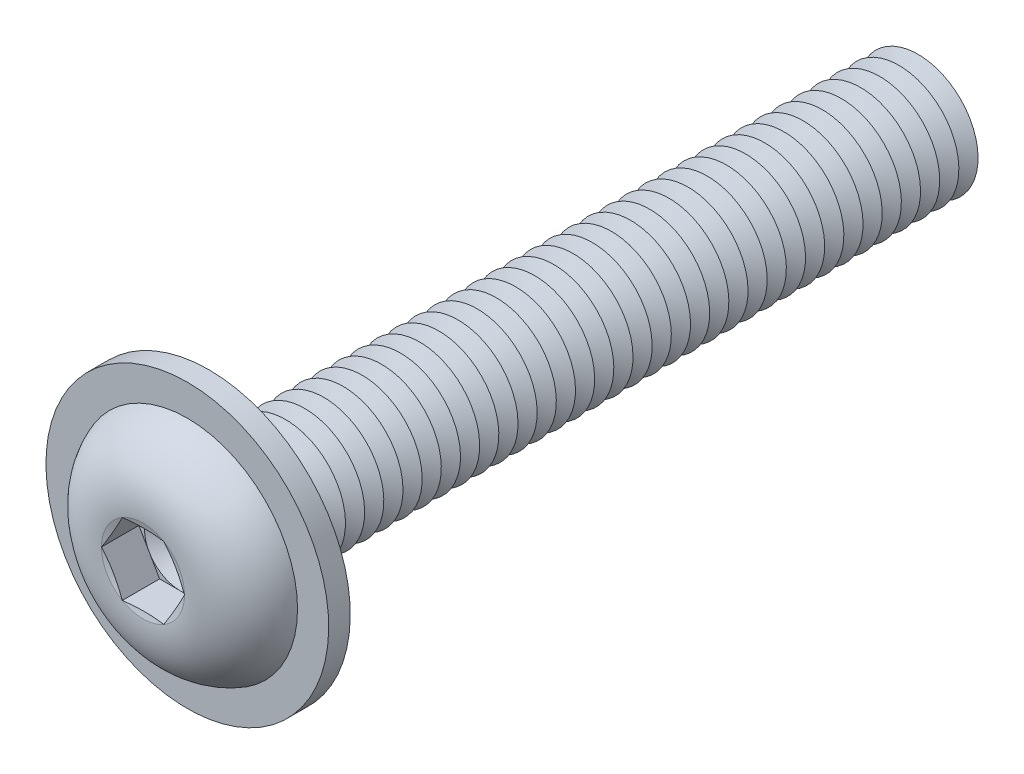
ISO-10303-21;
HEADER;
FILE_DESCRIPTION(('STEP AP214'),'2;1');
FILE_NAME('part.step','',(''),(''),'','','');
FILE_SCHEMA(('AUTOMOTIVE_DESIGN { 1 0 10303 214 1 1 1 1 }'));
ENDSEC;
DATA;
#1=APPLICATION_CONTEXT('core data for automotive mechanical design processes');
#2=APPLICATION_PROTOCOL_DEFINITION('international standard','automotive_design',2000,#1);
#3=PRODUCT_CONTEXT('',#1,'mechanical');
#4=PRODUCT('Part','Part','',(#3));
#5=PRODUCT_RELATED_PRODUCT_CATEGORY('part','',(#4));
#6=PRODUCT_DEFINITION_FORMATION('','',#4);
#7=PRODUCT_DEFINITION_CONTEXT('part definition',#1,'design');
#8=PRODUCT_DEFINITION('design','',#6,#7);
#9=PRODUCT_DEFINITION_SHAPE('','',#8);
#10=(LENGTH_UNIT() NAMED_UNIT(*) SI_UNIT(.MILLI.,.METRE.));
#11=(NAMED_UNIT(*) PLANE_ANGLE_UNIT() SI_UNIT($,.RADIAN.));
#12=(NAMED_UNIT(*) SI_UNIT($,.STERADIAN.) SOLID_ANGLE_UNIT());
#13=UNCERTAINTY_MEASURE_WITH_UNIT(LENGTH_MEASURE(1.E-05),#10,'distance_accuracy_value','');
#14=(GEOMETRIC_REPRESENTATION_CONTEXT(3) GLOBAL_UNCERTAINTY_ASSIGNED_CONTEXT((#13)) GLOBAL_UNIT_ASSIGNED_CONTEXT((#10,
#11,#12)) REPRESENTATION_CONTEXT('',''));
#15=CARTESIAN_POINT('',(0.,0.,0.));
#16=DIRECTION('',(0.,0.,1.));
#17=DIRECTION('',(1.,0.,0.));
#18=AXIS2_PLACEMENT_3D('',#15,#16,#17);
#19=CARTESIAN_POINT('',(0.,0.,-27.2));
#20=DIRECTION('',(0.,0.,1.));
#21=DIRECTION('',(0.,-1.,0.));
#22=AXIS2_PLACEMENT_3D('',#19,#20,#21);
#23=CONICAL_SURFACE('',#22,2.49999999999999,1.0471975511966);
#24=CARTESIAN_POINT('',(0.,0.,-27.6));
#25=DIRECTION('',(0.,0.,1.));
#26=DIRECTION('',(0.,-1.,0.));
#27=AXIS2_PLACEMENT_3D('',#24,#25,#26);
#28=CIRCLE('',#27,1.80717967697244);
#29=CARTESIAN_POINT('',(0.,-1.80717967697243,-27.6));
#30=VERTEX_POINT('',#29);
#31=EDGE_CURVE('E505',#30,#30,#28,.T.);
#32=ORIENTED_EDGE('',*,*,#31,.T.);
#33=EDGE_LOOP('',(#32));
#34=FACE_BOUND('',#33,.T.);
#35=CARTESIAN_POINT('',(0.,0.,-27.2));
#36=DIRECTION('',(0.,0.,1.));
#37=DIRECTION('',(0.,-1.,0.));
#38=AXIS2_PLACEMENT_3D('',#35,#36,#37);
#39=CIRCLE('',#38,2.49999999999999);
#40=CARTESIAN_POINT('',(0.,-2.49999999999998,-27.2));
#41=VERTEX_POINT('',#40);
#42=EDGE_CURVE('E501',#41,#41,#39,.T.);
#43=ORIENTED_EDGE('',*,*,#42,.F.);
#44=EDGE_LOOP('',(#43));
#45=FACE_BOUND('',#44,.T.);
#46=ADVANCED_FACE('F39',(#34,#45),#23,.T.);
#47=CARTESIAN_POINT('',(0.,0.,-27.6));
#48=DIRECTION('',(0.,0.,-1.));
#49=DIRECTION('',(0.,1.,0.));
#50=AXIS2_PLACEMENT_3D('',#47,#48,#49);
#51=CONICAL_SURFACE('',#50,1.80717967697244,1.0471975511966);
#52=CARTESIAN_POINT('',(0.,0.,-28.));
#53=DIRECTION('',(0.,0.,1.));
#54=DIRECTION('',(0.,-1.,0.));
#55=AXIS2_PLACEMENT_3D('',#52,#53,#54);
#56=CIRCLE('',#55,2.49999999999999);
#57=CARTESIAN_POINT('',(0.,-2.49999999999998,-28.));
#58=VERTEX_POINT('',#57);
#59=EDGE_CURVE('E509',#58,#58,#56,.T.);
#60=ORIENTED_EDGE('',*,*,#59,.T.);
#61=EDGE_LOOP('',(#60));
#62=FACE_BOUND('',#61,.T.);
#63=ORIENTED_EDGE('',*,*,#31,.F.);
#64=EDGE_LOOP('',(#63));
#65=FACE_BOUND('',#64,.T.);
#66=ADVANCED_FACE('F629',(#62,#65),#51,.T.);
#67=CARTESIAN_POINT('',(0.,2.5,-30.));
#68=DIRECTION('',(0.,0.,-1.));
#69=DIRECTION('',(0.,1.,0.));
#70=AXIS2_PLACEMENT_3D('',#67,#68,#69);
#71=PLANE('',#70);
#72=CARTESIAN_POINT('',(0.,0.,-30.));
#73=DIRECTION('',(0.,0.,1.));
#74=DIRECTION('',(0.,-1.,0.));
#75=AXIS2_PLACEMENT_3D('',#72,#73,#74);
#76=CIRCLE('',#75,1.80717967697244);
#77=CARTESIAN_POINT('',(0.,-1.80717967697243,-30.));
#78=VERTEX_POINT('',#77);
#79=EDGE_CURVE('E529',#78,#78,#76,.T.);
#80=ORIENTED_EDGE('',*,*,#79,.F.);
#81=EDGE_LOOP('',(#80));
#82=FACE_BOUND('',#81,.T.);
#83=ADVANCED_FACE('F635',(#82),#71,.T.);
#84=CARTESIAN_POINT('',(0.,0.,-29.6));
#85=DIRECTION('',(0.,0.,1.));
#86=DIRECTION('',(0.,-1.,0.));
#87=AXIS2_PLACEMENT_3D('',#84,#85,#86);
#88=CONICAL_SURFACE('',#87,2.49999999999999,1.0471975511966);
#89=ORIENTED_EDGE('',*,*,#79,.T.);
#90=EDGE_LOOP('',(#89));
#91=FACE_BOUND('',#90,.T.);
#92=CARTESIAN_POINT('',(0.,0.,-29.6));
#93=DIRECTION('',(0.,0.,1.));
#94=DIRECTION('',(0.,-1.,0.));
#95=AXIS2_PLACEMENT_3D('',#92,#93,#94);
#96=CIRCLE('',#95,2.49999999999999);
#97=CARTESIAN_POINT('',(0.,-2.49999999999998,-29.6));
#98=VERTEX_POINT('',#97);
#99=EDGE_CURVE('E525',#98,#98,#96,.T.);
#100=ORIENTED_EDGE('',*,*,#99,.F.);
#101=EDGE_LOOP('',(#100));
#102=FACE_BOUND('',#101,.T.);
#103=ADVANCED_FACE('F654',(#91,#102),#88,.T.);
#104=CARTESIAN_POINT('',(0.,0.,-29.2));
#105=DIRECTION('',(0.,0.,-1.));
#106=DIRECTION('',(0.,1.,0.));
#107=AXIS2_PLACEMENT_3D('',#104,#105,#106);
#108=CONICAL_SURFACE('',#107,1.80717967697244,1.0471975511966);
#109=ORIENTED_EDGE('',*,*,#99,.T.);
#110=EDGE_LOOP('',(#109));
#111=FACE_BOUND('',#110,.T.);
#112=CARTESIAN_POINT('',(0.,0.,-29.2));
#113=DIRECTION('',(0.,0.,1.));
#114=DIRECTION('',(0.,-1.,0.));
#115=AXIS2_PLACEMENT_3D('',#112,#113,#114);
#116=CIRCLE('',#115,1.80717967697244);
#117=CARTESIAN_POINT('',(0.,-1.80717967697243,-29.2));
#118=VERTEX_POINT('',#117);
#119=EDGE_CURVE('E521',#118,#118,#116,.T.);
#120=ORIENTED_EDGE('',*,*,#119,.F.);
#121=EDGE_LOOP('',(#120));
#122=FACE_BOUND('',#121,.T.);
#123=ADVANCED_FACE('F651',(#111,#122),#108,.T.);
#124=CARTESIAN_POINT('',(0.,0.,-28.8));
#125=DIRECTION('',(0.,0.,1.));
#126=DIRECTION('',(0.,-1.,0.));
#127=AXIS2_PLACEMENT_3D('',#124,#125,#126);
#128=CONICAL_SURFACE('',#127,2.49999999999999,1.0471975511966);
#129=ORIENTED_EDGE('',*,*,#119,.T.);
#130=EDGE_LOOP('',(#129));
#131=FACE_BOUND('',#130,.T.);
#132=CARTESIAN_POINT('',(0.,0.,-28.8));
#133=DIRECTION('',(0.,0.,1.));
#134=DIRECTION('',(0.,-1.,0.));
#135=AXIS2_PLACEMENT_3D('',#132,#133,#134);
#136=CIRCLE('',#135,2.49999999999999);
#137=CARTESIAN_POINT('',(0.,-2.49999999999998,-28.8));
#138=VERTEX_POINT('',#137);
#139=EDGE_CURVE('E517',#138,#138,#136,.T.);
#140=ORIENTED_EDGE('',*,*,#139,.F.);
#141=EDGE_LOOP('',(#140));
#142=FACE_BOUND('',#141,.T.);
#143=ADVANCED_FACE('F645',(#131,#142),#128,.T.);
#144=CARTESIAN_POINT('',(0.,0.,-28.4));
#145=DIRECTION('',(0.,0.,-1.));
#146=DIRECTION('',(0.,1.,0.));
#147=AXIS2_PLACEMENT_3D('',#144,#145,#146);
#148=CONICAL_SURFACE('',#147,1.80717967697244,1.0471975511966);
#149=ORIENTED_EDGE('',*,*,#139,.T.);
#150=EDGE_LOOP('',(#149));
#151=FACE_BOUND('',#150,.T.);
#152=CARTESIAN_POINT('',(0.,0.,-28.4));
#153=DIRECTION('',(0.,0.,1.));
#154=DIRECTION('',(0.,-1.,0.));
#155=AXIS2_PLACEMENT_3D('',#152,#153,#154);
#156=CIRCLE('',#155,1.80717967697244);
#157=CARTESIAN_POINT('',(0.,-1.80717967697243,-28.4));
#158=VERTEX_POINT('',#157);
#159=EDGE_CURVE('E513',#158,#158,#156,.T.);
#160=ORIENTED_EDGE('',*,*,#159,.F.);
#161=EDGE_LOOP('',(#160));
#162=FACE_BOUND('',#161,.T.);
#163=ADVANCED_FACE('F641',(#151,#162),#148,.T.);
#164=CARTESIAN_POINT('',(0.,0.,-28.));
#165=DIRECTION('',(0.,0.,1.));
#166=DIRECTION('',(0.,-1.,0.));
#167=AXIS2_PLACEMENT_3D('',#164,#165,#166);
#168=CONICAL_SURFACE('',#167,2.49999999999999,1.0471975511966);
#169=ORIENTED_EDGE('',*,*,#159,.T.);
#170=EDGE_LOOP('',(#169));
#171=FACE_BOUND('',#170,.T.);
#172=ORIENTED_EDGE('',*,*,#59,.F.);
#173=EDGE_LOOP('',(#172));
#174=FACE_BOUND('',#173,.T.);
#175=ADVANCED_FACE('F644',(#171,#174),#168,.T.);
#176=CARTESIAN_POINT('',(0.,0.,-26.4));
#177=DIRECTION('',(0.,0.,1.));
#178=DIRECTION('',(0.,-1.,0.));
#179=AXIS2_PLACEMENT_3D('',#176,#177,#178);
#180=CONICAL_SURFACE('',#179,2.49999999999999,1.0471975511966);
#181=CARTESIAN_POINT('',(0.,0.,-26.8));
#182=DIRECTION('',(0.,0.,1.));
#183=DIRECTION('',(0.,-1.,0.));
#184=AXIS2_PLACEMENT_3D('',#181,#182,#183);
#185=CIRCLE('',#184,1.80717967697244);
#186=CARTESIAN_POINT('',(0.,-1.80717967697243,-26.8));
#187=VERTEX_POINT('',#186);
#188=EDGE_CURVE('E497',#187,#187,#185,.T.);
#189=ORIENTED_EDGE('',*,*,#188,.T.);
#190=EDGE_LOOP('',(#189));
#191=FACE_BOUND('',#190,.T.);
#192=CARTESIAN_POINT('',(0.,0.,-26.4));
#193=DIRECTION('',(0.,0.,1.));
#194=DIRECTION('',(0.,-1.,0.));
#195=AXIS2_PLACEMENT_3D('',#192,#193,#194);
#196=CIRCLE('',#195,2.49999999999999);
#197=CARTESIAN_POINT('',(0.,-2.49999999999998,-26.4));
#198=VERTEX_POINT('',#197);
#199=EDGE_CURVE('E493',#198,#198,#196,.T.);
#200=ORIENTED_EDGE('',*,*,#199,.F.);
#201=EDGE_LOOP('',(#200));
#202=FACE_BOUND('',#201,.T.);
#203=ADVANCED_FACE('F649',(#191,#202),#180,.T.);
#204=CARTESIAN_POINT('',(0.,0.,-26.8));
#205=DIRECTION('',(0.,0.,-1.));
#206=DIRECTION('',(0.,1.,0.));
#207=AXIS2_PLACEMENT_3D('',#204,#205,#206);
#208=CONICAL_SURFACE('',#207,1.80717967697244,1.0471975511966);
#209=ORIENTED_EDGE('',*,*,#42,.T.);
#210=EDGE_LOOP('',(#209));
#211=FACE_BOUND('',#210,.T.);
#212=ORIENTED_EDGE('',*,*,#188,.F.);
#213=EDGE_LOOP('',(#212));
#214=FACE_BOUND('',#213,.T.);
#215=ADVANCED_FACE('F700',(#211,#214),#208,.T.);
#216=CARTESIAN_POINT('',(0.,0.,-25.6));
#217=DIRECTION('',(0.,0.,1.));
#218=DIRECTION('',(0.,-1.,0.));
#219=AXIS2_PLACEMENT_3D('',#216,#217,#218);
#220=CONICAL_SURFACE('',#219,2.49999999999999,1.0471975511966);
#221=CARTESIAN_POINT('',(0.,0.,-26.));
#222=DIRECTION('',(0.,0.,1.));
#223=DIRECTION('',(0.,-1.,0.));
#224=AXIS2_PLACEMENT_3D('',#221,#222,#223);
#225=CIRCLE('',#224,1.80717967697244);
#226=CARTESIAN_POINT('',(0.,-1.80717967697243,-26.));
#227=VERTEX_POINT('',#226);
#228=EDGE_CURVE('E489',#227,#227,#225,.T.);
#229=ORIENTED_EDGE('',*,*,#228,.T.);
#230=EDGE_LOOP('',(#229));
#231=FACE_BOUND('',#230,.T.);
#232=CARTESIAN_POINT('',(0.,0.,-25.6));
#233=DIRECTION('',(0.,0.,1.));
#234=DIRECTION('',(0.,-1.,0.));
#235=AXIS2_PLACEMENT_3D('',#232,#233,#234);
#236=CIRCLE('',#235,2.49999999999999);
#237=CARTESIAN_POINT('',(0.,-2.49999999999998,-25.6));
#238=VERTEX_POINT('',#237);
#239=EDGE_CURVE('E485',#238,#238,#236,.T.);
#240=ORIENTED_EDGE('',*,*,#239,.F.);
#241=EDGE_LOOP('',(#240));
#242=FACE_BOUND('',#241,.T.);
#243=ADVANCED_FACE('F706',(#231,#242),#220,.T.);
#244=CARTESIAN_POINT('',(0.,0.,-26.));
#245=DIRECTION('',(0.,0.,-1.));
#246=DIRECTION('',(0.,1.,0.));
#247=AXIS2_PLACEMENT_3D('',#244,#245,#246);
#248=CONICAL_SURFACE('',#247,1.80717967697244,1.0471975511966);
#249=ORIENTED_EDGE('',*,*,#199,.T.);
#250=EDGE_LOOP('',(#249));
#251=FACE_BOUND('',#250,.T.);
#252=ORIENTED_EDGE('',*,*,#228,.F.);
#253=EDGE_LOOP('',(#252));
#254=FACE_BOUND('',#253,.T.);
#255=ADVANCED_FACE('F713',(#251,#254),#248,.T.);
#256=CARTESIAN_POINT('',(0.,0.,-24.8));
#257=DIRECTION('',(0.,0.,1.));
#258=DIRECTION('',(0.,-1.,0.));
#259=AXIS2_PLACEMENT_3D('',#256,#257,#258);
#260=CONICAL_SURFACE('',#259,2.49999999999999,1.0471975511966);
#261=CARTESIAN_POINT('',(0.,0.,-25.2));
#262=DIRECTION('',(0.,0.,1.));
#263=DIRECTION('',(0.,-1.,0.));
#264=AXIS2_PLACEMENT_3D('',#261,#262,#263);
#265=CIRCLE('',#264,1.80717967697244);
#266=CARTESIAN_POINT('',(0.,-1.80717967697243,-25.2));
#267=VERTEX_POINT('',#266);
#268=EDGE_CURVE('E481',#267,#267,#265,.T.);
#269=ORIENTED_EDGE('',*,*,#268,.T.);
#270=EDGE_LOOP('',(#269));
#271=FACE_BOUND('',#270,.T.);
#272=CARTESIAN_POINT('',(0.,0.,-24.8));
#273=DIRECTION('',(0.,0.,1.));
#274=DIRECTION('',(0.,-1.,0.));
#275=AXIS2_PLACEMENT_3D('',#272,#273,#274);
#276=CIRCLE('',#275,2.49999999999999);
#277=CARTESIAN_POINT('',(0.,-2.49999999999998,-24.8));
#278=VERTEX_POINT('',#277);
#279=EDGE_CURVE('E477',#278,#278,#276,.T.);
#280=ORIENTED_EDGE('',*,*,#279,.F.);
#281=EDGE_LOOP('',(#280));
#282=FACE_BOUND('',#281,.T.);
#283=ADVANCED_FACE('F720',(#271,#282),#260,.T.);
#284=CARTESIAN_POINT('',(0.,0.,-25.2));
#285=DIRECTION('',(0.,0.,-1.));
#286=DIRECTION('',(0.,1.,0.));
#287=AXIS2_PLACEMENT_3D('',#284,#285,#286);
#288=CONICAL_SURFACE('',#287,1.80717967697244,1.0471975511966);
#289=ORIENTED_EDGE('',*,*,#239,.T.);
#290=EDGE_LOOP('',(#289));
#291=FACE_BOUND('',#290,.T.);
#292=ORIENTED_EDGE('',*,*,#268,.F.);
#293=EDGE_LOOP('',(#292));
#294=FACE_BOUND('',#293,.T.);
#295=ADVANCED_FACE('F727',(#291,#294),#288,.T.);
#296=CARTESIAN_POINT('',(0.,0.,-24.));
#297=DIRECTION('',(0.,0.,1.));
#298=DIRECTION('',(0.,-1.,0.));
#299=AXIS2_PLACEMENT_3D('',#296,#297,#298);
#300=CONICAL_SURFACE('',#299,2.49999999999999,1.0471975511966);
#301=CARTESIAN_POINT('',(0.,0.,-24.4));
#302=DIRECTION('',(0.,0.,1.));
#303=DIRECTION('',(0.,-1.,0.));
#304=AXIS2_PLACEMENT_3D('',#301,#302,#303);
#305=CIRCLE('',#304,1.80717967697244);
#306=CARTESIAN_POINT('',(0.,-1.80717967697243,-24.4));
#307=VERTEX_POINT('',#306);
#308=EDGE_CURVE('E473',#307,#307,#305,.T.);
#309=ORIENTED_EDGE('',*,*,#308,.T.);
#310=EDGE_LOOP('',(#309));
#311=FACE_BOUND('',#310,.T.);
#312=CARTESIAN_POINT('',(0.,0.,-24.));
#313=DIRECTION('',(0.,0.,1.));
#314=DIRECTION('',(0.,-1.,0.));
#315=AXIS2_PLACEMENT_3D('',#312,#313,#314);
#316=CIRCLE('',#315,2.49999999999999);
#317=CARTESIAN_POINT('',(0.,-2.49999999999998,-24.));
#318=VERTEX_POINT('',#317);
#319=EDGE_CURVE('E469',#318,#318,#316,.T.);
#320=ORIENTED_EDGE('',*,*,#319,.F.);
#321=EDGE_LOOP('',(#320));
#322=FACE_BOUND('',#321,.T.);
#323=ADVANCED_FACE('F734',(#311,#322),#300,.T.);
#324=CARTESIAN_POINT('',(0.,0.,-24.4));
#325=DIRECTION('',(0.,0.,-1.));
#326=DIRECTION('',(0.,1.,0.));
#327=AXIS2_PLACEMENT_3D('',#324,#325,#326);
#328=CONICAL_SURFACE('',#327,1.80717967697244,1.0471975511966);
#329=ORIENTED_EDGE('',*,*,#279,.T.);
#330=EDGE_LOOP('',(#329));
#331=FACE_BOUND('',#330,.T.);
#332=ORIENTED_EDGE('',*,*,#308,.F.);
#333=EDGE_LOOP('',(#332));
#334=FACE_BOUND('',#333,.T.);
#335=ADVANCED_FACE('F741',(#331,#334),#328,.T.);
#336=CARTESIAN_POINT('',(0.,0.,-23.2));
#337=DIRECTION('',(0.,0.,1.));
#338=DIRECTION('',(0.,-1.,0.));
#339=AXIS2_PLACEMENT_3D('',#336,#337,#338);
#340=CONICAL_SURFACE('',#339,2.49999999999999,1.0471975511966);
#341=CARTESIAN_POINT('',(0.,0.,-23.6));
#342=DIRECTION('',(0.,0.,1.));
#343=DIRECTION('',(0.,-1.,0.));
#344=AXIS2_PLACEMENT_3D('',#341,#342,#343);
#345=CIRCLE('',#344,1.80717967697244);
#346=CARTESIAN_POINT('',(0.,-1.80717967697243,-23.6));
#347=VERTEX_POINT('',#346);
#348=EDGE_CURVE('E465',#347,#347,#345,.T.);
#349=ORIENTED_EDGE('',*,*,#348,.T.);
#350=EDGE_LOOP('',(#349));
#351=FACE_BOUND('',#350,.T.);
#352=CARTESIAN_POINT('',(0.,0.,-23.2));
#353=DIRECTION('',(0.,0.,1.));
#354=DIRECTION('',(0.,-1.,0.));
#355=AXIS2_PLACEMENT_3D('',#352,#353,#354);
#356=CIRCLE('',#355,2.49999999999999);
#357=CARTESIAN_POINT('',(0.,-2.49999999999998,-23.2));
#358=VERTEX_POINT('',#357);
#359=EDGE_CURVE('E461',#358,#358,#356,.T.);
#360=ORIENTED_EDGE('',*,*,#359,.F.);
#361=EDGE_LOOP('',(#360));
#362=FACE_BOUND('',#361,.T.);
#363=ADVANCED_FACE('F748',(#351,#362),#340,.T.);
#364=CARTESIAN_POINT('',(0.,0.,-23.6));
#365=DIRECTION('',(0.,0.,-1.));
#366=DIRECTION('',(0.,1.,0.));
#367=AXIS2_PLACEMENT_3D('',#364,#365,#366);
#368=CONICAL_SURFACE('',#367,1.80717967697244,1.0471975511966);
#369=ORIENTED_EDGE('',*,*,#319,.T.);
#370=EDGE_LOOP('',(#369));
#371=FACE_BOUND('',#370,.T.);
#372=ORIENTED_EDGE('',*,*,#348,.F.);
#373=EDGE_LOOP('',(#372));
#374=FACE_BOUND('',#373,.T.);
#375=ADVANCED_FACE('F755',(#371,#374),#368,.T.);
#376=CARTESIAN_POINT('',(0.,0.,-22.4));
#377=DIRECTION('',(0.,0.,1.));
#378=DIRECTION('',(0.,-1.,0.));
#379=AXIS2_PLACEMENT_3D('',#376,#377,#378);
#380=CONICAL_SURFACE('',#379,2.49999999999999,1.0471975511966);
#381=CARTESIAN_POINT('',(0.,0.,-22.8));
#382=DIRECTION('',(0.,0.,1.));
#383=DIRECTION('',(0.,-1.,0.));
#384=AXIS2_PLACEMENT_3D('',#381,#382,#383);
#385=CIRCLE('',#384,1.80717967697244);
#386=CARTESIAN_POINT('',(0.,-1.80717967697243,-22.8));
#387=VERTEX_POINT('',#386);
#388=EDGE_CURVE('E457',#387,#387,#385,.T.);
#389=ORIENTED_EDGE('',*,*,#388,.T.);
#390=EDGE_LOOP('',(#389));
#391=FACE_BOUND('',#390,.T.);
#392=CARTESIAN_POINT('',(0.,0.,-22.4));
#393=DIRECTION('',(0.,0.,1.));
#394=DIRECTION('',(0.,-1.,0.));
#395=AXIS2_PLACEMENT_3D('',#392,#393,#394);
#396=CIRCLE('',#395,2.49999999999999);
#397=CARTESIAN_POINT('',(0.,-2.49999999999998,-22.4));
#398=VERTEX_POINT('',#397);
#399=EDGE_CURVE('E453',#398,#398,#396,.T.);
#400=ORIENTED_EDGE('',*,*,#399,.F.);
#401=EDGE_LOOP('',(#400));
#402=FACE_BOUND('',#401,.T.);
#403=ADVANCED_FACE('F762',(#391,#402),#380,.T.);
#404=CARTESIAN_POINT('',(0.,0.,-22.8));
#405=DIRECTION('',(0.,0.,-1.));
#406=DIRECTION('',(0.,1.,0.));
#407=AXIS2_PLACEMENT_3D('',#404,#405,#406);
#408=CONICAL_SURFACE('',#407,1.80717967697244,1.0471975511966);
#409=ORIENTED_EDGE('',*,*,#359,.T.);
#410=EDGE_LOOP('',(#409));
#411=FACE_BOUND('',#410,.T.);
#412=ORIENTED_EDGE('',*,*,#388,.F.);
#413=EDGE_LOOP('',(#412));
#414=FACE_BOUND('',#413,.T.);
#415=ADVANCED_FACE('F769',(#411,#414),#408,.T.);
#416=CARTESIAN_POINT('',(0.,0.,-21.6));
#417=DIRECTION('',(0.,0.,1.));
#418=DIRECTION('',(0.,-1.,0.));
#419=AXIS2_PLACEMENT_3D('',#416,#417,#418);
#420=CONICAL_SURFACE('',#419,2.49999999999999,1.0471975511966);
#421=CARTESIAN_POINT('',(0.,0.,-22.));
#422=DIRECTION('',(0.,0.,1.));
#423=DIRECTION('',(0.,-1.,0.));
#424=AXIS2_PLACEMENT_3D('',#421,#422,#423);
#425=CIRCLE('',#424,1.80717967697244);
#426=CARTESIAN_POINT('',(0.,-1.80717967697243,-22.));
#427=VERTEX_POINT('',#426);
#428=EDGE_CURVE('E449',#427,#427,#425,.T.);
#429=ORIENTED_EDGE('',*,*,#428,.T.);
#430=EDGE_LOOP('',(#429));
#431=FACE_BOUND('',#430,.T.);
#432=CARTESIAN_POINT('',(0.,0.,-21.6));
#433=DIRECTION('',(0.,0.,1.));
#434=DIRECTION('',(0.,-1.,0.));
#435=AXIS2_PLACEMENT_3D('',#432,#433,#434);
#436=CIRCLE('',#435,2.49999999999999);
#437=CARTESIAN_POINT('',(0.,-2.49999999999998,-21.6));
#438=VERTEX_POINT('',#437);
#439=EDGE_CURVE('E445',#438,#438,#436,.T.);
#440=ORIENTED_EDGE('',*,*,#439,.F.);
#441=EDGE_LOOP('',(#440));
#442=FACE_BOUND('',#441,.T.);
#443=ADVANCED_FACE('F776',(#431,#442),#420,.T.);
#444=CARTESIAN_POINT('',(0.,0.,-22.));
#445=DIRECTION('',(0.,0.,-1.));
#446=DIRECTION('',(0.,1.,0.));
#447=AXIS2_PLACEMENT_3D('',#444,#445,#446);
#448=CONICAL_SURFACE('',#447,1.80717967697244,1.0471975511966);
#449=ORIENTED_EDGE('',*,*,#399,.T.);
#450=EDGE_LOOP('',(#449));
#451=FACE_BOUND('',#450,.T.);
#452=ORIENTED_EDGE('',*,*,#428,.F.);
#453=EDGE_LOOP('',(#452));
#454=FACE_BOUND('',#453,.T.);
#455=ADVANCED_FACE('F783',(#451,#454),#448,.T.);
#456=CARTESIAN_POINT('',(0.,0.,-20.8));
#457=DIRECTION('',(0.,0.,1.));
#458=DIRECTION('',(0.,-1.,0.));
#459=AXIS2_PLACEMENT_3D('',#456,#457,#458);
#460=CONICAL_SURFACE('',#459,2.49999999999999,1.0471975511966);
#461=CARTESIAN_POINT('',(0.,0.,-21.2));
#462=DIRECTION('',(0.,0.,1.));
#463=DIRECTION('',(0.,-1.,0.));
#464=AXIS2_PLACEMENT_3D('',#461,#462,#463);
#465=CIRCLE('',#464,1.80717967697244);
#466=CARTESIAN_POINT('',(0.,-1.80717967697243,-21.2));
#467=VERTEX_POINT('',#466);
#468=EDGE_CURVE('E441',#467,#467,#465,.T.);
#469=ORIENTED_EDGE('',*,*,#468,.T.);
#470=EDGE_LOOP('',(#469));
#471=FACE_BOUND('',#470,.T.);
#472=CARTESIAN_POINT('',(0.,0.,-20.8));
#473=DIRECTION('',(0.,0.,1.));
#474=DIRECTION('',(0.,-1.,0.));
#475=AXIS2_PLACEMENT_3D('',#472,#473,#474);
#476=CIRCLE('',#475,2.49999999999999);
#477=CARTESIAN_POINT('',(0.,-2.49999999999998,-20.8));
#478=VERTEX_POINT('',#477);
#479=EDGE_CURVE('E437',#478,#478,#476,.T.);
#480=ORIENTED_EDGE('',*,*,#479,.F.);
#481=EDGE_LOOP('',(#480));
#482=FACE_BOUND('',#481,.T.);
#483=ADVANCED_FACE('F790',(#471,#482),#460,.T.);
#484=CARTESIAN_POINT('',(0.,0.,-21.2));
#485=DIRECTION('',(0.,0.,-1.));
#486=DIRECTION('',(0.,1.,0.));
#487=AXIS2_PLACEMENT_3D('',#484,#485,#486);
#488=CONICAL_SURFACE('',#487,1.80717967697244,1.0471975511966);
#489=ORIENTED_EDGE('',*,*,#439,.T.);
#490=EDGE_LOOP('',(#489));
#491=FACE_BOUND('',#490,.T.);
#492=ORIENTED_EDGE('',*,*,#468,.F.);
#493=EDGE_LOOP('',(#492));
#494=FACE_BOUND('',#493,.T.);
#495=ADVANCED_FACE('F797',(#491,#494),#488,.T.);
#496=CARTESIAN_POINT('',(0.,0.,-20.));
#497=DIRECTION('',(0.,0.,1.));
#498=DIRECTION('',(0.,-1.,0.));
#499=AXIS2_PLACEMENT_3D('',#496,#497,#498);
#500=CONICAL_SURFACE('',#499,2.49999999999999,1.0471975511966);
#501=CARTESIAN_POINT('',(0.,0.,-20.4));
#502=DIRECTION('',(0.,0.,1.));
#503=DIRECTION('',(0.,-1.,0.));
#504=AXIS2_PLACEMENT_3D('',#501,#502,#503);
#505=CIRCLE('',#504,1.80717967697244);
#506=CARTESIAN_POINT('',(0.,-1.80717967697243,-20.4));
#507=VERTEX_POINT('',#506);
#508=EDGE_CURVE('E433',#507,#507,#505,.T.);
#509=ORIENTED_EDGE('',*,*,#508,.T.);
#510=EDGE_LOOP('',(#509));
#511=FACE_BOUND('',#510,.T.);
#512=CARTESIAN_POINT('',(0.,0.,-20.));
#513=DIRECTION('',(0.,0.,1.));
#514=DIRECTION('',(0.,-1.,0.));
#515=AXIS2_PLACEMENT_3D('',#512,#513,#514);
#516=CIRCLE('',#515,2.49999999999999);
#517=CARTESIAN_POINT('',(0.,-2.49999999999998,-20.));
#518=VERTEX_POINT('',#517);
#519=EDGE_CURVE('E429',#518,#518,#516,.T.);
#520=ORIENTED_EDGE('',*,*,#519,.F.);
#521=EDGE_LOOP('',(#520));
#522=FACE_BOUND('',#521,.T.);
#523=ADVANCED_FACE('F804',(#511,#522),#500,.T.);
#524=CARTESIAN_POINT('',(0.,0.,-20.4));
#525=DIRECTION('',(0.,0.,-1.));
#526=DIRECTION('',(0.,1.,0.));
#527=AXIS2_PLACEMENT_3D('',#524,#525,#526);
#528=CONICAL_SURFACE('',#527,1.80717967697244,1.0471975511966);
#529=ORIENTED_EDGE('',*,*,#479,.T.);
#530=EDGE_LOOP('',(#529));
#531=FACE_BOUND('',#530,.T.);
#532=ORIENTED_EDGE('',*,*,#508,.F.);
#533=EDGE_LOOP('',(#532));
#534=FACE_BOUND('',#533,.T.);
#535=ADVANCED_FACE('F811',(#531,#534),#528,.T.);
#536=CARTESIAN_POINT('',(0.,0.,-19.2));
#537=DIRECTION('',(0.,0.,1.));
#538=DIRECTION('',(0.,-1.,0.));
#539=AXIS2_PLACEMENT_3D('',#536,#537,#538);
#540=CONICAL_SURFACE('',#539,2.49999999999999,1.0471975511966);
#541=CARTESIAN_POINT('',(0.,0.,-19.6));
#542=DIRECTION('',(0.,0.,1.));
#543=DIRECTION('',(0.,-1.,0.));
#544=AXIS2_PLACEMENT_3D('',#541,#542,#543);
#545=CIRCLE('',#544,1.80717967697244);
#546=CARTESIAN_POINT('',(0.,-1.80717967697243,-19.6));
#547=VERTEX_POINT('',#546);
#548=EDGE_CURVE('E425',#547,#547,#545,.T.);
#549=ORIENTED_EDGE('',*,*,#548,.T.);
#550=EDGE_LOOP('',(#549));
#551=FACE_BOUND('',#550,.T.);
#552=CARTESIAN_POINT('',(0.,0.,-19.2));
#553=DIRECTION('',(0.,0.,1.));
#554=DIRECTION('',(0.,-1.,0.));
#555=AXIS2_PLACEMENT_3D('',#552,#553,#554);
#556=CIRCLE('',#555,2.49999999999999);
#557=CARTESIAN_POINT('',(0.,-2.49999999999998,-19.2));
#558=VERTEX_POINT('',#557);
#559=EDGE_CURVE('E421',#558,#558,#556,.T.);
#560=ORIENTED_EDGE('',*,*,#559,.F.);
#561=EDGE_LOOP('',(#560));
#562=FACE_BOUND('',#561,.T.);
#563=ADVANCED_FACE('F818',(#551,#562),#540,.T.);
#564=CARTESIAN_POINT('',(0.,0.,-19.6));
#565=DIRECTION('',(0.,0.,-1.));
#566=DIRECTION('',(0.,1.,0.));
#567=AXIS2_PLACEMENT_3D('',#564,#565,#566);
#568=CONICAL_SURFACE('',#567,1.80717967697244,1.0471975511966);
#569=ORIENTED_EDGE('',*,*,#519,.T.);
#570=EDGE_LOOP('',(#569));
#571=FACE_BOUND('',#570,.T.);
#572=ORIENTED_EDGE('',*,*,#548,.F.);
#573=EDGE_LOOP('',(#572));
#574=FACE_BOUND('',#573,.T.);
#575=ADVANCED_FACE('F825',(#571,#574),#568,.T.);
#576=CARTESIAN_POINT('',(0.,0.,-18.4));
#577=DIRECTION('',(0.,0.,1.));
#578=DIRECTION('',(0.,-1.,0.));
#579=AXIS2_PLACEMENT_3D('',#576,#577,#578);
#580=CONICAL_SURFACE('',#579,2.49999999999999,1.0471975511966);
#581=CARTESIAN_POINT('',(0.,0.,-18.8));
#582=DIRECTION('',(0.,0.,1.));
#583=DIRECTION('',(0.,-1.,0.));
#584=AXIS2_PLACEMENT_3D('',#581,#582,#583);
#585=CIRCLE('',#584,1.80717967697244);
#586=CARTESIAN_POINT('',(0.,-1.80717967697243,-18.8));
#587=VERTEX_POINT('',#586);
#588=EDGE_CURVE('E417',#587,#587,#585,.T.);
#589=ORIENTED_EDGE('',*,*,#588,.T.);
#590=EDGE_LOOP('',(#589));
#591=FACE_BOUND('',#590,.T.);
#592=CARTESIAN_POINT('',(0.,0.,-18.4));
#593=DIRECTION('',(0.,0.,1.));
#594=DIRECTION('',(0.,-1.,0.));
#595=AXIS2_PLACEMENT_3D('',#592,#593,#594);
#596=CIRCLE('',#595,2.49999999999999);
#597=CARTESIAN_POINT('',(0.,-2.49999999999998,-18.4));
#598=VERTEX_POINT('',#597);
#599=EDGE_CURVE('E413',#598,#598,#596,.T.);
#600=ORIENTED_EDGE('',*,*,#599,.F.);
#601=EDGE_LOOP('',(#600));
#602=FACE_BOUND('',#601,.T.);
#603=ADVANCED_FACE('F832',(#591,#602),#580,.T.);
#604=CARTESIAN_POINT('',(0.,0.,-18.8));
#605=DIRECTION('',(0.,0.,-1.));
#606=DIRECTION('',(0.,1.,0.));
#607=AXIS2_PLACEMENT_3D('',#604,#605,#606);
#608=CONICAL_SURFACE('',#607,1.80717967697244,1.0471975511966);
#609=ORIENTED_EDGE('',*,*,#559,.T.);
#610=EDGE_LOOP('',(#609));
#611=FACE_BOUND('',#610,.T.);
#612=ORIENTED_EDGE('',*,*,#588,.F.);
#613=EDGE_LOOP('',(#612));
#614=FACE_BOUND('',#613,.T.);
#615=ADVANCED_FACE('F839',(#611,#614),#608,.T.);
#616=CARTESIAN_POINT('',(0.,0.,-17.6));
#617=DIRECTION('',(0.,0.,1.));
#618=DIRECTION('',(0.,-1.,0.));
#619=AXIS2_PLACEMENT_3D('',#616,#617,#618);
#620=CONICAL_SURFACE('',#619,2.49999999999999,1.0471975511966);
#621=CARTESIAN_POINT('',(0.,0.,-18.));
#622=DIRECTION('',(0.,0.,1.));
#623=DIRECTION('',(0.,-1.,0.));
#624=AXIS2_PLACEMENT_3D('',#621,#622,#623);
#625=CIRCLE('',#624,1.80717967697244);
#626=CARTESIAN_POINT('',(0.,-1.80717967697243,-18.));
#627=VERTEX_POINT('',#626);
#628=EDGE_CURVE('E409',#627,#627,#625,.T.);
#629=ORIENTED_EDGE('',*,*,#628,.T.);
#630=EDGE_LOOP('',(#629));
#631=FACE_BOUND('',#630,.T.);
#632=CARTESIAN_POINT('',(0.,0.,-17.6));
#633=DIRECTION('',(0.,0.,1.));
#634=DIRECTION('',(0.,-1.,0.));
#635=AXIS2_PLACEMENT_3D('',#632,#633,#634);
#636=CIRCLE('',#635,2.49999999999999);
#637=CARTESIAN_POINT('',(0.,-2.49999999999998,-17.6));
#638=VERTEX_POINT('',#637);
#639=EDGE_CURVE('E405',#638,#638,#636,.T.);
#640=ORIENTED_EDGE('',*,*,#639,.F.);
#641=EDGE_LOOP('',(#640));
#642=FACE_BOUND('',#641,.T.);
#643=ADVANCED_FACE('F846',(#631,#642),#620,.T.);
#644=CARTESIAN_POINT('',(0.,0.,-18.));
#645=DIRECTION('',(0.,0.,-1.));
#646=DIRECTION('',(0.,1.,0.));
#647=AXIS2_PLACEMENT_3D('',#644,#645,#646);
#648=CONICAL_SURFACE('',#647,1.80717967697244,1.0471975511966);
#649=ORIENTED_EDGE('',*,*,#599,.T.);
#650=EDGE_LOOP('',(#649));
#651=FACE_BOUND('',#650,.T.);
#652=ORIENTED_EDGE('',*,*,#628,.F.);
#653=EDGE_LOOP('',(#652));
#654=FACE_BOUND('',#653,.T.);
#655=ADVANCED_FACE('F853',(#651,#654),#648,.T.);
#656=CARTESIAN_POINT('',(0.,0.,-16.8));
#657=DIRECTION('',(0.,0.,1.));
#658=DIRECTION('',(0.,-1.,0.));
#659=AXIS2_PLACEMENT_3D('',#656,#657,#658);
#660=CONICAL_SURFACE('',#659,2.49999999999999,1.0471975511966);
#661=CARTESIAN_POINT('',(0.,0.,-17.2));
#662=DIRECTION('',(0.,0.,1.));
#663=DIRECTION('',(0.,-1.,0.));
#664=AXIS2_PLACEMENT_3D('',#661,#662,#663);
#665=CIRCLE('',#664,1.80717967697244);
#666=CARTESIAN_POINT('',(0.,-1.80717967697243,-17.2));
#667=VERTEX_POINT('',#666);
#668=EDGE_CURVE('E401',#667,#667,#665,.T.);
#669=ORIENTED_EDGE('',*,*,#668,.T.);
#670=EDGE_LOOP('',(#669));
#671=FACE_BOUND('',#670,.T.);
#672=CARTESIAN_POINT('',(0.,0.,-16.8));
#673=DIRECTION('',(0.,0.,1.));
#674=DIRECTION('',(0.,-1.,0.));
#675=AXIS2_PLACEMENT_3D('',#672,#673,#674);
#676=CIRCLE('',#675,2.49999999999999);
#677=CARTESIAN_POINT('',(0.,-2.49999999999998,-16.8));
#678=VERTEX_POINT('',#677);
#679=EDGE_CURVE('E397',#678,#678,#676,.T.);
#680=ORIENTED_EDGE('',*,*,#679,.F.);
#681=EDGE_LOOP('',(#680));
#682=FACE_BOUND('',#681,.T.);
#683=ADVANCED_FACE('F860',(#671,#682),#660,.T.);
#684=CARTESIAN_POINT('',(0.,0.,-17.2));
#685=DIRECTION('',(0.,0.,-1.));
#686=DIRECTION('',(0.,1.,0.));
#687=AXIS2_PLACEMENT_3D('',#684,#685,#686);
#688=CONICAL_SURFACE('',#687,1.80717967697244,1.0471975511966);
#689=ORIENTED_EDGE('',*,*,#639,.T.);
#690=EDGE_LOOP('',(#689));
#691=FACE_BOUND('',#690,.T.);
#692=ORIENTED_EDGE('',*,*,#668,.F.);
#693=EDGE_LOOP('',(#692));
#694=FACE_BOUND('',#693,.T.);
#695=ADVANCED_FACE('F867',(#691,#694),#688,.T.);
#696=CARTESIAN_POINT('',(0.,0.,-16.));
#697=DIRECTION('',(0.,0.,1.));
#698=DIRECTION('',(0.,-1.,0.));
#699=AXIS2_PLACEMENT_3D('',#696,#697,#698);
#700=CONICAL_SURFACE('',#699,2.49999999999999,1.0471975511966);
#701=CARTESIAN_POINT('',(0.,0.,-16.4));
#702=DIRECTION('',(0.,0.,1.));
#703=DIRECTION('',(0.,-1.,0.));
#704=AXIS2_PLACEMENT_3D('',#701,#702,#703);
#705=CIRCLE('',#704,1.80717967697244);
#706=CARTESIAN_POINT('',(0.,-1.80717967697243,-16.4));
#707=VERTEX_POINT('',#706);
#708=EDGE_CURVE('E393',#707,#707,#705,.T.);
#709=ORIENTED_EDGE('',*,*,#708,.T.);
#710=EDGE_LOOP('',(#709));
#711=FACE_BOUND('',#710,.T.);
#712=CARTESIAN_POINT('',(0.,0.,-16.));
#713=DIRECTION('',(0.,0.,1.));
#714=DIRECTION('',(0.,-1.,0.));
#715=AXIS2_PLACEMENT_3D('',#712,#713,#714);
#716=CIRCLE('',#715,2.49999999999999);
#717=CARTESIAN_POINT('',(0.,-2.49999999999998,-16.));
#718=VERTEX_POINT('',#717);
#719=EDGE_CURVE('E389',#718,#718,#716,.T.);
#720=ORIENTED_EDGE('',*,*,#719,.F.);
#721=EDGE_LOOP('',(#720));
#722=FACE_BOUND('',#721,.T.);
#723=ADVANCED_FACE('F874',(#711,#722),#700,.T.);
#724=CARTESIAN_POINT('',(0.,0.,-16.4));
#725=DIRECTION('',(0.,0.,-1.));
#726=DIRECTION('',(0.,1.,0.));
#727=AXIS2_PLACEMENT_3D('',#724,#725,#726);
#728=CONICAL_SURFACE('',#727,1.80717967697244,1.0471975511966);
#729=ORIENTED_EDGE('',*,*,#679,.T.);
#730=EDGE_LOOP('',(#729));
#731=FACE_BOUND('',#730,.T.);
#732=ORIENTED_EDGE('',*,*,#708,.F.);
#733=EDGE_LOOP('',(#732));
#734=FACE_BOUND('',#733,.T.);
#735=ADVANCED_FACE('F881',(#731,#734),#728,.T.);
#736=CARTESIAN_POINT('',(0.,0.,-15.2));
#737=DIRECTION('',(0.,0.,1.));
#738=DIRECTION('',(0.,-1.,0.));
#739=AXIS2_PLACEMENT_3D('',#736,#737,#738);
#740=CONICAL_SURFACE('',#739,2.49999999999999,1.0471975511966);
#741=CARTESIAN_POINT('',(0.,0.,-15.6));
#742=DIRECTION('',(0.,0.,1.));
#743=DIRECTION('',(0.,-1.,0.));
#744=AXIS2_PLACEMENT_3D('',#741,#742,#743);
#745=CIRCLE('',#744,1.80717967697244);
#746=CARTESIAN_POINT('',(0.,-1.80717967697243,-15.6));
#747=VERTEX_POINT('',#746);
#748=EDGE_CURVE('E385',#747,#747,#745,.T.);
#749=ORIENTED_EDGE('',*,*,#748,.T.);
#750=EDGE_LOOP('',(#749));
#751=FACE_BOUND('',#750,.T.);
#752=CARTESIAN_POINT('',(0.,0.,-15.2));
#753=DIRECTION('',(0.,0.,1.));
#754=DIRECTION('',(0.,-1.,0.));
#755=AXIS2_PLACEMENT_3D('',#752,#753,#754);
#756=CIRCLE('',#755,2.49999999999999);
#757=CARTESIAN_POINT('',(0.,-2.49999999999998,-15.2));
#758=VERTEX_POINT('',#757);
#759=EDGE_CURVE('E381',#758,#758,#756,.T.);
#760=ORIENTED_EDGE('',*,*,#759,.F.);
#761=EDGE_LOOP('',(#760));
#762=FACE_BOUND('',#761,.T.);
#763=ADVANCED_FACE('F888',(#751,#762),#740,.T.);
#764=CARTESIAN_POINT('',(0.,0.,-15.6));
#765=DIRECTION('',(0.,0.,-1.));
#766=DIRECTION('',(0.,1.,0.));
#767=AXIS2_PLACEMENT_3D('',#764,#765,#766);
#768=CONICAL_SURFACE('',#767,1.80717967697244,1.0471975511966);
#769=ORIENTED_EDGE('',*,*,#719,.T.);
#770=EDGE_LOOP('',(#769));
#771=FACE_BOUND('',#770,.T.);
#772=ORIENTED_EDGE('',*,*,#748,.F.);
#773=EDGE_LOOP('',(#772));
#774=FACE_BOUND('',#773,.T.);
#775=ADVANCED_FACE('F895',(#771,#774),#768,.T.);
#776=CARTESIAN_POINT('',(0.,0.,-14.4));
#777=DIRECTION('',(0.,0.,1.));
#778=DIRECTION('',(0.,-1.,0.));
#779=AXIS2_PLACEMENT_3D('',#776,#777,#778);
#780=CONICAL_SURFACE('',#779,2.49999999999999,1.0471975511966);
#781=CARTESIAN_POINT('',(0.,0.,-14.8));
#782=DIRECTION('',(0.,0.,1.));
#783=DIRECTION('',(0.,-1.,0.));
#784=AXIS2_PLACEMENT_3D('',#781,#782,#783);
#785=CIRCLE('',#784,1.80717967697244);
#786=CARTESIAN_POINT('',(0.,-1.80717967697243,-14.8));
#787=VERTEX_POINT('',#786);
#788=EDGE_CURVE('E377',#787,#787,#785,.T.);
#789=ORIENTED_EDGE('',*,*,#788,.T.);
#790=EDGE_LOOP('',(#789));
#791=FACE_BOUND('',#790,.T.);
#792=CARTESIAN_POINT('',(0.,0.,-14.4));
#793=DIRECTION('',(0.,0.,1.));
#794=DIRECTION('',(0.,-1.,0.));
#795=AXIS2_PLACEMENT_3D('',#792,#793,#794);
#796=CIRCLE('',#795,2.49999999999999);
#797=CARTESIAN_POINT('',(0.,-2.49999999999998,-14.4));
#798=VERTEX_POINT('',#797);
#799=EDGE_CURVE('E373',#798,#798,#796,.T.);
#800=ORIENTED_EDGE('',*,*,#799,.F.);
#801=EDGE_LOOP('',(#800));
#802=FACE_BOUND('',#801,.T.);
#803=ADVANCED_FACE('F902',(#791,#802),#780,.T.);
#804=CARTESIAN_POINT('',(0.,0.,-14.8));
#805=DIRECTION('',(0.,0.,-1.));
#806=DIRECTION('',(0.,1.,0.));
#807=AXIS2_PLACEMENT_3D('',#804,#805,#806);
#808=CONICAL_SURFACE('',#807,1.80717967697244,1.0471975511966);
#809=ORIENTED_EDGE('',*,*,#759,.T.);
#810=EDGE_LOOP('',(#809));
#811=FACE_BOUND('',#810,.T.);
#812=ORIENTED_EDGE('',*,*,#788,.F.);
#813=EDGE_LOOP('',(#812));
#814=FACE_BOUND('',#813,.T.);
#815=ADVANCED_FACE('F909',(#811,#814),#808,.T.);
#816=CARTESIAN_POINT('',(0.,0.,-13.6));
#817=DIRECTION('',(0.,0.,1.));
#818=DIRECTION('',(0.,-1.,0.));
#819=AXIS2_PLACEMENT_3D('',#816,#817,#818);
#820=CONICAL_SURFACE('',#819,2.49999999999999,1.0471975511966);
#821=CARTESIAN_POINT('',(0.,0.,-14.));
#822=DIRECTION('',(0.,0.,1.));
#823=DIRECTION('',(0.,-1.,0.));
#824=AXIS2_PLACEMENT_3D('',#821,#822,#823);
#825=CIRCLE('',#824,1.80717967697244);
#826=CARTESIAN_POINT('',(0.,-1.80717967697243,-14.));
#827=VERTEX_POINT('',#826);
#828=EDGE_CURVE('E369',#827,#827,#825,.T.);
#829=ORIENTED_EDGE('',*,*,#828,.T.);
#830=EDGE_LOOP('',(#829));
#831=FACE_BOUND('',#830,.T.);
#832=CARTESIAN_POINT('',(0.,0.,-13.6));
#833=DIRECTION('',(0.,0.,1.));
#834=DIRECTION('',(0.,-1.,0.));
#835=AXIS2_PLACEMENT_3D('',#832,#833,#834);
#836=CIRCLE('',#835,2.49999999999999);
#837=CARTESIAN_POINT('',(0.,-2.49999999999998,-13.6));
#838=VERTEX_POINT('',#837);
#839=EDGE_CURVE('E365',#838,#838,#836,.T.);
#840=ORIENTED_EDGE('',*,*,#839,.F.);
#841=EDGE_LOOP('',(#840));
#842=FACE_BOUND('',#841,.T.);
#843=ADVANCED_FACE('F916',(#831,#842),#820,.T.);
#844=CARTESIAN_POINT('',(0.,0.,-14.));
#845=DIRECTION('',(0.,0.,-1.));
#846=DIRECTION('',(0.,1.,0.));
#847=AXIS2_PLACEMENT_3D('',#844,#845,#846);
#848=CONICAL_SURFACE('',#847,1.80717967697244,1.0471975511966);
#849=ORIENTED_EDGE('',*,*,#799,.T.);
#850=EDGE_LOOP('',(#849));
#851=FACE_BOUND('',#850,.T.);
#852=ORIENTED_EDGE('',*,*,#828,.F.);
#853=EDGE_LOOP('',(#852));
#854=FACE_BOUND('',#853,.T.);
#855=ADVANCED_FACE('F923',(#851,#854),#848,.T.);
#856=CARTESIAN_POINT('',(0.,0.,-12.8));
#857=DIRECTION('',(0.,0.,1.));
#858=DIRECTION('',(0.,-1.,0.));
#859=AXIS2_PLACEMENT_3D('',#856,#857,#858);
#860=CONICAL_SURFACE('',#859,2.49999999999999,1.0471975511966);
#861=CARTESIAN_POINT('',(0.,0.,-13.2));
#862=DIRECTION('',(0.,0.,1.));
#863=DIRECTION('',(0.,-1.,0.));
#864=AXIS2_PLACEMENT_3D('',#861,#862,#863);
#865=CIRCLE('',#864,1.80717967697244);
#866=CARTESIAN_POINT('',(0.,-1.80717967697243,-13.2));
#867=VERTEX_POINT('',#866);
#868=EDGE_CURVE('E361',#867,#867,#865,.T.);
#869=ORIENTED_EDGE('',*,*,#868,.T.);
#870=EDGE_LOOP('',(#869));
#871=FACE_BOUND('',#870,.T.);
#872=CARTESIAN_POINT('',(0.,0.,-12.8));
#873=DIRECTION('',(0.,0.,1.));
#874=DIRECTION('',(0.,-1.,0.));
#875=AXIS2_PLACEMENT_3D('',#872,#873,#874);
#876=CIRCLE('',#875,2.49999999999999);
#877=CARTESIAN_POINT('',(0.,-2.49999999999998,-12.8));
#878=VERTEX_POINT('',#877);
#879=EDGE_CURVE('E357',#878,#878,#876,.T.);
#880=ORIENTED_EDGE('',*,*,#879,.F.);
#881=EDGE_LOOP('',(#880));
#882=FACE_BOUND('',#881,.T.);
#883=ADVANCED_FACE('F930',(#871,#882),#860,.T.);
#884=CARTESIAN_POINT('',(0.,0.,-13.2));
#885=DIRECTION('',(0.,0.,-1.));
#886=DIRECTION('',(0.,1.,0.));
#887=AXIS2_PLACEMENT_3D('',#884,#885,#886);
#888=CONICAL_SURFACE('',#887,1.80717967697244,1.0471975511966);
#889=ORIENTED_EDGE('',*,*,#839,.T.);
#890=EDGE_LOOP('',(#889));
#891=FACE_BOUND('',#890,.T.);
#892=ORIENTED_EDGE('',*,*,#868,.F.);
#893=EDGE_LOOP('',(#892));
#894=FACE_BOUND('',#893,.T.);
#895=ADVANCED_FACE('F937',(#891,#894),#888,.T.);
#896=CARTESIAN_POINT('',(0.,0.,-12.));
#897=DIRECTION('',(0.,0.,1.));
#898=DIRECTION('',(0.,-1.,0.));
#899=AXIS2_PLACEMENT_3D('',#896,#897,#898);
#900=CONICAL_SURFACE('',#899,2.49999999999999,1.0471975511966);
#901=CARTESIAN_POINT('',(0.,0.,-12.4));
#902=DIRECTION('',(0.,0.,1.));
#903=DIRECTION('',(0.,-1.,0.));
#904=AXIS2_PLACEMENT_3D('',#901,#902,#903);
#905=CIRCLE('',#904,1.80717967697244);
#906=CARTESIAN_POINT('',(0.,-1.80717967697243,-12.4));
#907=VERTEX_POINT('',#906);
#908=EDGE_CURVE('E353',#907,#907,#905,.T.);
#909=ORIENTED_EDGE('',*,*,#908,.T.);
#910=EDGE_LOOP('',(#909));
#911=FACE_BOUND('',#910,.T.);
#912=CARTESIAN_POINT('',(0.,0.,-12.));
#913=DIRECTION('',(0.,0.,1.));
#914=DIRECTION('',(0.,-1.,0.));
#915=AXIS2_PLACEMENT_3D('',#912,#913,#914);
#916=CIRCLE('',#915,2.49999999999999);
#917=CARTESIAN_POINT('',(0.,-2.49999999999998,-12.));
#918=VERTEX_POINT('',#917);
#919=EDGE_CURVE('E349',#918,#918,#916,.T.);
#920=ORIENTED_EDGE('',*,*,#919,.F.);
#921=EDGE_LOOP('',(#920));
#922=FACE_BOUND('',#921,.T.);
#923=ADVANCED_FACE('F944',(#911,#922),#900,.T.);
#924=CARTESIAN_POINT('',(0.,0.,-12.4));
#925=DIRECTION('',(0.,0.,-1.));
#926=DIRECTION('',(0.,1.,0.));
#927=AXIS2_PLACEMENT_3D('',#924,#925,#926);
#928=CONICAL_SURFACE('',#927,1.80717967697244,1.0471975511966);
#929=ORIENTED_EDGE('',*,*,#879,.T.);
#930=EDGE_LOOP('',(#929));
#931=FACE_BOUND('',#930,.T.);
#932=ORIENTED_EDGE('',*,*,#908,.F.);
#933=EDGE_LOOP('',(#932));
#934=FACE_BOUND('',#933,.T.);
#935=ADVANCED_FACE('F951',(#931,#934),#928,.T.);
#936=CARTESIAN_POINT('',(0.,0.,-11.2));
#937=DIRECTION('',(0.,0.,1.));
#938=DIRECTION('',(0.,-1.,0.));
#939=AXIS2_PLACEMENT_3D('',#936,#937,#938);
#940=CONICAL_SURFACE('',#939,2.49999999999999,1.0471975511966);
#941=CARTESIAN_POINT('',(0.,0.,-11.6));
#942=DIRECTION('',(0.,0.,1.));
#943=DIRECTION('',(0.,-1.,0.));
#944=AXIS2_PLACEMENT_3D('',#941,#942,#943);
#945=CIRCLE('',#944,1.80717967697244);
#946=CARTESIAN_POINT('',(0.,-1.80717967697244,-11.6));
#947=VERTEX_POINT('',#946);
#948=EDGE_CURVE('E345',#947,#947,#945,.T.);
#949=ORIENTED_EDGE('',*,*,#948,.T.);
#950=EDGE_LOOP('',(#949));
#951=FACE_BOUND('',#950,.T.);
#952=CARTESIAN_POINT('',(0.,0.,-11.2));
#953=DIRECTION('',(0.,0.,1.));
#954=DIRECTION('',(0.,-1.,0.));
#955=AXIS2_PLACEMENT_3D('',#952,#953,#954);
#956=CIRCLE('',#955,2.49999999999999);
#957=CARTESIAN_POINT('',(0.,-2.49999999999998,-11.2));
#958=VERTEX_POINT('',#957);
#959=EDGE_CURVE('E341',#958,#958,#956,.T.);
#960=ORIENTED_EDGE('',*,*,#959,.F.);
#961=EDGE_LOOP('',(#960));
#962=FACE_BOUND('',#961,.T.);
#963=ADVANCED_FACE('F958',(#951,#962),#940,.T.);
#964=CARTESIAN_POINT('',(0.,0.,-11.6));
#965=DIRECTION('',(0.,0.,-1.));
#966=DIRECTION('',(0.,1.,0.));
#967=AXIS2_PLACEMENT_3D('',#964,#965,#966);
#968=CONICAL_SURFACE('',#967,1.80717967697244,1.0471975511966);
#969=ORIENTED_EDGE('',*,*,#919,.T.);
#970=EDGE_LOOP('',(#969));
#971=FACE_BOUND('',#970,.T.);
#972=ORIENTED_EDGE('',*,*,#948,.F.);
#973=EDGE_LOOP('',(#972));
#974=FACE_BOUND('',#973,.T.);
#975=ADVANCED_FACE('F965',(#971,#974),#968,.T.);
#976=CARTESIAN_POINT('',(0.,0.,-10.4));
#977=DIRECTION('',(0.,0.,1.));
#978=DIRECTION('',(0.,-1.,0.));
#979=AXIS2_PLACEMENT_3D('',#976,#977,#978);
#980=CONICAL_SURFACE('',#979,2.49999999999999,1.0471975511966);
#981=CARTESIAN_POINT('',(0.,0.,-10.8));
#982=DIRECTION('',(0.,0.,1.));
#983=DIRECTION('',(0.,-1.,0.));
#984=AXIS2_PLACEMENT_3D('',#981,#982,#983);
#985=CIRCLE('',#984,1.80717967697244);
#986=CARTESIAN_POINT('',(0.,-1.80717967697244,-10.8));
#987=VERTEX_POINT('',#986);
#988=EDGE_CURVE('E337',#987,#987,#985,.T.);
#989=ORIENTED_EDGE('',*,*,#988,.T.);
#990=EDGE_LOOP('',(#989));
#991=FACE_BOUND('',#990,.T.);
#992=CARTESIAN_POINT('',(0.,0.,-10.4));
#993=DIRECTION('',(0.,0.,1.));
#994=DIRECTION('',(0.,-1.,0.));
#995=AXIS2_PLACEMENT_3D('',#992,#993,#994);
#996=CIRCLE('',#995,2.49999999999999);
#997=CARTESIAN_POINT('',(0.,-2.49999999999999,-10.4));
#998=VERTEX_POINT('',#997);
#999=EDGE_CURVE('E333',#998,#998,#996,.T.);
#1000=ORIENTED_EDGE('',*,*,#999,.F.);
#1001=EDGE_LOOP('',(#1000));
#1002=FACE_BOUND('',#1001,.T.);
#1003=ADVANCED_FACE('F972',(#991,#1002),#980,.T.);
#1004=CARTESIAN_POINT('',(0.,0.,-10.8));
#1005=DIRECTION('',(0.,0.,-1.));
#1006=DIRECTION('',(0.,1.,0.));
#1007=AXIS2_PLACEMENT_3D('',#1004,#1005,#1006);
#1008=CONICAL_SURFACE('',#1007,1.80717967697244,1.0471975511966);
#1009=ORIENTED_EDGE('',*,*,#959,.T.);
#1010=EDGE_LOOP('',(#1009));
#1011=FACE_BOUND('',#1010,.T.);
#1012=ORIENTED_EDGE('',*,*,#988,.F.);
#1013=EDGE_LOOP('',(#1012));
#1014=FACE_BOUND('',#1013,.T.);
#1015=ADVANCED_FACE('F979',(#1011,#1014),#1008,.T.);
#1016=CARTESIAN_POINT('',(0.,0.,-9.6));
#1017=DIRECTION('',(0.,0.,1.));
#1018=DIRECTION('',(0.,-1.,0.));
#1019=AXIS2_PLACEMENT_3D('',#1016,#1017,#1018);
#1020=CONICAL_SURFACE('',#1019,2.49999999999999,1.0471975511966);
#1021=CARTESIAN_POINT('',(0.,0.,-10.));
#1022=DIRECTION('',(0.,0.,1.));
#1023=DIRECTION('',(0.,-1.,0.));
#1024=AXIS2_PLACEMENT_3D('',#1021,#1022,#1023);
#1025=CIRCLE('',#1024,1.80717967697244);
#1026=CARTESIAN_POINT('',(0.,-1.80717967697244,-10.));
#1027=VERTEX_POINT('',#1026);
#1028=EDGE_CURVE('E329',#1027,#1027,#1025,.T.);
#1029=ORIENTED_EDGE('',*,*,#1028,.T.);
#1030=EDGE_LOOP('',(#1029));
#1031=FACE_BOUND('',#1030,.T.);
#1032=CARTESIAN_POINT('',(0.,0.,-9.6));
#1033=DIRECTION('',(0.,0.,1.));
#1034=DIRECTION('',(0.,-1.,0.));
#1035=AXIS2_PLACEMENT_3D('',#1032,#1033,#1034);
#1036=CIRCLE('',#1035,2.49999999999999);
#1037=CARTESIAN_POINT('',(0.,-2.49999999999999,-9.6));
#1038=VERTEX_POINT('',#1037);
#1039=EDGE_CURVE('E325',#1038,#1038,#1036,.T.);
#1040=ORIENTED_EDGE('',*,*,#1039,.F.);
#1041=EDGE_LOOP('',(#1040));
#1042=FACE_BOUND('',#1041,.T.);
#1043=ADVANCED_FACE('F986',(#1031,#1042),#1020,.T.);
#1044=CARTESIAN_POINT('',(0.,0.,-10.));
#1045=DIRECTION('',(0.,0.,-1.));
#1046=DIRECTION('',(0.,1.,0.));
#1047=AXIS2_PLACEMENT_3D('',#1044,#1045,#1046);
#1048=CONICAL_SURFACE('',#1047,1.80717967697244,1.0471975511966);
#1049=ORIENTED_EDGE('',*,*,#999,.T.);
#1050=EDGE_LOOP('',(#1049));
#1051=FACE_BOUND('',#1050,.T.);
#1052=ORIENTED_EDGE('',*,*,#1028,.F.);
#1053=EDGE_LOOP('',(#1052));
#1054=FACE_BOUND('',#1053,.T.);
#1055=ADVANCED_FACE('F993',(#1051,#1054),#1048,.T.);
#1056=CARTESIAN_POINT('',(0.,0.,-8.8));
#1057=DIRECTION('',(0.,0.,1.));
#1058=DIRECTION('',(0.,-1.,0.));
#1059=AXIS2_PLACEMENT_3D('',#1056,#1057,#1058);
#1060=CONICAL_SURFACE('',#1059,2.49999999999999,1.0471975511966);
#1061=CARTESIAN_POINT('',(0.,0.,-9.2));
#1062=DIRECTION('',(0.,0.,1.));
#1063=DIRECTION('',(0.,-1.,0.));
#1064=AXIS2_PLACEMENT_3D('',#1061,#1062,#1063);
#1065=CIRCLE('',#1064,1.80717967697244);
#1066=CARTESIAN_POINT('',(0.,-1.80717967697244,-9.2));
#1067=VERTEX_POINT('',#1066);
#1068=EDGE_CURVE('E321',#1067,#1067,#1065,.T.);
#1069=ORIENTED_EDGE('',*,*,#1068,.T.);
#1070=EDGE_LOOP('',(#1069));
#1071=FACE_BOUND('',#1070,.T.);
#1072=CARTESIAN_POINT('',(0.,0.,-8.8));
#1073=DIRECTION('',(0.,0.,1.));
#1074=DIRECTION('',(0.,-1.,0.));
#1075=AXIS2_PLACEMENT_3D('',#1072,#1073,#1074);
#1076=CIRCLE('',#1075,2.49999999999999);
#1077=CARTESIAN_POINT('',(0.,-2.49999999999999,-8.8));
#1078=VERTEX_POINT('',#1077);
#1079=EDGE_CURVE('E317',#1078,#1078,#1076,.T.);
#1080=ORIENTED_EDGE('',*,*,#1079,.F.);
#1081=EDGE_LOOP('',(#1080));
#1082=FACE_BOUND('',#1081,.T.);
#1083=ADVANCED_FACE('F1000',(#1071,#1082),#1060,.T.);
#1084=CARTESIAN_POINT('',(0.,0.,-9.2));
#1085=DIRECTION('',(0.,0.,-1.));
#1086=DIRECTION('',(0.,1.,0.));
#1087=AXIS2_PLACEMENT_3D('',#1084,#1085,#1086);
#1088=CONICAL_SURFACE('',#1087,1.80717967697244,1.0471975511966);
#1089=ORIENTED_EDGE('',*,*,#1039,.T.);
#1090=EDGE_LOOP('',(#1089));
#1091=FACE_BOUND('',#1090,.T.);
#1092=ORIENTED_EDGE('',*,*,#1068,.F.);
#1093=EDGE_LOOP('',(#1092));
#1094=FACE_BOUND('',#1093,.T.);
#1095=ADVANCED_FACE('F1007',(#1091,#1094),#1088,.T.);
#1096=CARTESIAN_POINT('',(0.,0.,-8.));
#1097=DIRECTION('',(0.,0.,1.));
#1098=DIRECTION('',(0.,-1.,0.));
#1099=AXIS2_PLACEMENT_3D('',#1096,#1097,#1098);
#1100=CONICAL_SURFACE('',#1099,2.49999999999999,1.0471975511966);
#1101=CARTESIAN_POINT('',(0.,0.,-8.4));
#1102=DIRECTION('',(0.,0.,1.));
#1103=DIRECTION('',(0.,-1.,0.));
#1104=AXIS2_PLACEMENT_3D('',#1101,#1102,#1103);
#1105=CIRCLE('',#1104,1.80717967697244);
#1106=CARTESIAN_POINT('',(0.,-1.80717967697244,-8.4));
#1107=VERTEX_POINT('',#1106);
#1108=EDGE_CURVE('E313',#1107,#1107,#1105,.T.);
#1109=ORIENTED_EDGE('',*,*,#1108,.T.);
#1110=EDGE_LOOP('',(#1109));
#1111=FACE_BOUND('',#1110,.T.);
#1112=CARTESIAN_POINT('',(0.,0.,-8.));
#1113=DIRECTION('',(0.,0.,1.));
#1114=DIRECTION('',(0.,-1.,0.));
#1115=AXIS2_PLACEMENT_3D('',#1112,#1113,#1114);
#1116=CIRCLE('',#1115,2.49999999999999);
#1117=CARTESIAN_POINT('',(0.,-2.49999999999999,-8.));
#1118=VERTEX_POINT('',#1117);
#1119=EDGE_CURVE('E309',#1118,#1118,#1116,.T.);
#1120=ORIENTED_EDGE('',*,*,#1119,.F.);
#1121=EDGE_LOOP('',(#1120));
#1122=FACE_BOUND('',#1121,.T.);
#1123=ADVANCED_FACE('F1014',(#1111,#1122),#1100,.T.);
#1124=CARTESIAN_POINT('',(0.,0.,-8.4));
#1125=DIRECTION('',(0.,0.,-1.));
#1126=DIRECTION('',(0.,1.,0.));
#1127=AXIS2_PLACEMENT_3D('',#1124,#1125,#1126);
#1128=CONICAL_SURFACE('',#1127,1.80717967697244,1.0471975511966);
#1129=ORIENTED_EDGE('',*,*,#1079,.T.);
#1130=EDGE_LOOP('',(#1129));
#1131=FACE_BOUND('',#1130,.T.);
#1132=ORIENTED_EDGE('',*,*,#1108,.F.);
#1133=EDGE_LOOP('',(#1132));
#1134=FACE_BOUND('',#1133,.T.);
#1135=ADVANCED_FACE('F1021',(#1131,#1134),#1128,.T.);
#1136=CARTESIAN_POINT('',(0.,0.,-7.2));
#1137=DIRECTION('',(0.,0.,1.));
#1138=DIRECTION('',(0.,-1.,0.));
#1139=AXIS2_PLACEMENT_3D('',#1136,#1137,#1138);
#1140=CONICAL_SURFACE('',#1139,2.49999999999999,1.0471975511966);
#1141=CARTESIAN_POINT('',(0.,0.,-7.6));
#1142=DIRECTION('',(0.,0.,1.));
#1143=DIRECTION('',(0.,-1.,0.));
#1144=AXIS2_PLACEMENT_3D('',#1141,#1142,#1143);
#1145=CIRCLE('',#1144,1.80717967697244);
#1146=CARTESIAN_POINT('',(0.,-1.80717967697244,-7.6));
#1147=VERTEX_POINT('',#1146);
#1148=EDGE_CURVE('E305',#1147,#1147,#1145,.T.);
#1149=ORIENTED_EDGE('',*,*,#1148,.T.);
#1150=EDGE_LOOP('',(#1149));
#1151=FACE_BOUND('',#1150,.T.);
#1152=CARTESIAN_POINT('',(0.,0.,-7.2));
#1153=DIRECTION('',(0.,0.,1.));
#1154=DIRECTION('',(0.,-1.,0.));
#1155=AXIS2_PLACEMENT_3D('',#1152,#1153,#1154);
#1156=CIRCLE('',#1155,2.49999999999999);
#1157=CARTESIAN_POINT('',(0.,-2.49999999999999,-7.2));
#1158=VERTEX_POINT('',#1157);
#1159=EDGE_CURVE('E301',#1158,#1158,#1156,.T.);
#1160=ORIENTED_EDGE('',*,*,#1159,.F.);
#1161=EDGE_LOOP('',(#1160));
#1162=FACE_BOUND('',#1161,.T.);
#1163=ADVANCED_FACE('F1028',(#1151,#1162),#1140,.T.);
#1164=CARTESIAN_POINT('',(0.,0.,-7.6));
#1165=DIRECTION('',(0.,0.,-1.));
#1166=DIRECTION('',(0.,1.,0.));
#1167=AXIS2_PLACEMENT_3D('',#1164,#1165,#1166);
#1168=CONICAL_SURFACE('',#1167,1.80717967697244,1.0471975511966);
#1169=ORIENTED_EDGE('',*,*,#1119,.T.);
#1170=EDGE_LOOP('',(#1169));
#1171=FACE_BOUND('',#1170,.T.);
#1172=ORIENTED_EDGE('',*,*,#1148,.F.);
#1173=EDGE_LOOP('',(#1172));
#1174=FACE_BOUND('',#1173,.T.);
#1175=ADVANCED_FACE('F1035',(#1171,#1174),#1168,.T.);
#1176=CARTESIAN_POINT('',(0.,0.,-6.4));
#1177=DIRECTION('',(0.,0.,1.));
#1178=DIRECTION('',(0.,-1.,0.));
#1179=AXIS2_PLACEMENT_3D('',#1176,#1177,#1178);
#1180=CONICAL_SURFACE('',#1179,2.49999999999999,1.0471975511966);
#1181=CARTESIAN_POINT('',(0.,0.,-6.8));
#1182=DIRECTION('',(0.,0.,1.));
#1183=DIRECTION('',(0.,-1.,0.));
#1184=AXIS2_PLACEMENT_3D('',#1181,#1182,#1183);
#1185=CIRCLE('',#1184,1.80717967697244);
#1186=CARTESIAN_POINT('',(0.,-1.80717967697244,-6.8));
#1187=VERTEX_POINT('',#1186);
#1188=EDGE_CURVE('E297',#1187,#1187,#1185,.T.);
#1189=ORIENTED_EDGE('',*,*,#1188,.T.);
#1190=EDGE_LOOP('',(#1189));
#1191=FACE_BOUND('',#1190,.T.);
#1192=CARTESIAN_POINT('',(0.,0.,-6.4));
#1193=DIRECTION('',(0.,0.,1.));
#1194=DIRECTION('',(0.,-1.,0.));
#1195=AXIS2_PLACEMENT_3D('',#1192,#1193,#1194);
#1196=CIRCLE('',#1195,2.49999999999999);
#1197=CARTESIAN_POINT('',(0.,-2.49999999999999,-6.4));
#1198=VERTEX_POINT('',#1197);
#1199=EDGE_CURVE('E293',#1198,#1198,#1196,.T.);
#1200=ORIENTED_EDGE('',*,*,#1199,.F.);
#1201=EDGE_LOOP('',(#1200));
#1202=FACE_BOUND('',#1201,.T.);
#1203=ADVANCED_FACE('F1042',(#1191,#1202),#1180,.T.);
#1204=CARTESIAN_POINT('',(0.,0.,-6.8));
#1205=DIRECTION('',(0.,0.,-1.));
#1206=DIRECTION('',(0.,1.,0.));
#1207=AXIS2_PLACEMENT_3D('',#1204,#1205,#1206);
#1208=CONICAL_SURFACE('',#1207,1.80717967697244,1.0471975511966);
#1209=ORIENTED_EDGE('',*,*,#1159,.T.);
#1210=EDGE_LOOP('',(#1209));
#1211=FACE_BOUND('',#1210,.T.);
#1212=ORIENTED_EDGE('',*,*,#1188,.F.);
#1213=EDGE_LOOP('',(#1212));
#1214=FACE_BOUND('',#1213,.T.);
#1215=ADVANCED_FACE('F1049',(#1211,#1214),#1208,.T.);
#1216=CARTESIAN_POINT('',(0.,0.,-5.6));
#1217=DIRECTION('',(0.,0.,1.));
#1218=DIRECTION('',(0.,-1.,0.));
#1219=AXIS2_PLACEMENT_3D('',#1216,#1217,#1218);
#1220=CONICAL_SURFACE('',#1219,2.49999999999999,1.0471975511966);
#1221=CARTESIAN_POINT('',(0.,0.,-6.));
#1222=DIRECTION('',(0.,0.,1.));
#1223=DIRECTION('',(0.,-1.,0.));
#1224=AXIS2_PLACEMENT_3D('',#1221,#1222,#1223);
#1225=CIRCLE('',#1224,1.80717967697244);
#1226=CARTESIAN_POINT('',(0.,-1.80717967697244,-6.));
#1227=VERTEX_POINT('',#1226);
#1228=EDGE_CURVE('E289',#1227,#1227,#1225,.T.);
#1229=ORIENTED_EDGE('',*,*,#1228,.T.);
#1230=EDGE_LOOP('',(#1229));
#1231=FACE_BOUND('',#1230,.T.);
#1232=CARTESIAN_POINT('',(0.,0.,-5.6));
#1233=DIRECTION('',(0.,0.,1.));
#1234=DIRECTION('',(0.,-1.,0.));
#1235=AXIS2_PLACEMENT_3D('',#1232,#1233,#1234);
#1236=CIRCLE('',#1235,2.49999999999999);
#1237=CARTESIAN_POINT('',(0.,-2.49999999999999,-5.6));
#1238=VERTEX_POINT('',#1237);
#1239=EDGE_CURVE('E285',#1238,#1238,#1236,.T.);
#1240=ORIENTED_EDGE('',*,*,#1239,.F.);
#1241=EDGE_LOOP('',(#1240));
#1242=FACE_BOUND('',#1241,.T.);
#1243=ADVANCED_FACE('F1056',(#1231,#1242),#1220,.T.);
#1244=CARTESIAN_POINT('',(0.,0.,-6.));
#1245=DIRECTION('',(0.,0.,-1.));
#1246=DIRECTION('',(0.,1.,0.));
#1247=AXIS2_PLACEMENT_3D('',#1244,#1245,#1246);
#1248=CONICAL_SURFACE('',#1247,1.80717967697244,1.0471975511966);
#1249=ORIENTED_EDGE('',*,*,#1199,.T.);
#1250=EDGE_LOOP('',(#1249));
#1251=FACE_BOUND('',#1250,.T.);
#1252=ORIENTED_EDGE('',*,*,#1228,.F.);
#1253=EDGE_LOOP('',(#1252));
#1254=FACE_BOUND('',#1253,.T.);
#1255=ADVANCED_FACE('F1063',(#1251,#1254),#1248,.T.);
#1256=CARTESIAN_POINT('',(0.,0.,-4.8));
#1257=DIRECTION('',(0.,0.,1.));
#1258=DIRECTION('',(0.,-1.,0.));
#1259=AXIS2_PLACEMENT_3D('',#1256,#1257,#1258);
#1260=CONICAL_SURFACE('',#1259,2.49999999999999,1.0471975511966);
#1261=CARTESIAN_POINT('',(0.,0.,-5.2));
#1262=DIRECTION('',(0.,0.,1.));
#1263=DIRECTION('',(0.,-1.,0.));
#1264=AXIS2_PLACEMENT_3D('',#1261,#1262,#1263);
#1265=CIRCLE('',#1264,1.80717967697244);
#1266=CARTESIAN_POINT('',(0.,-1.80717967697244,-5.2));
#1267=VERTEX_POINT('',#1266);
#1268=EDGE_CURVE('E281',#1267,#1267,#1265,.T.);
#1269=ORIENTED_EDGE('',*,*,#1268,.T.);
#1270=EDGE_LOOP('',(#1269));
#1271=FACE_BOUND('',#1270,.T.);
#1272=CARTESIAN_POINT('',(0.,0.,-4.8));
#1273=DIRECTION('',(0.,0.,1.));
#1274=DIRECTION('',(0.,-1.,0.));
#1275=AXIS2_PLACEMENT_3D('',#1272,#1273,#1274);
#1276=CIRCLE('',#1275,2.49999999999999);
#1277=CARTESIAN_POINT('',(0.,-2.49999999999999,-4.8));
#1278=VERTEX_POINT('',#1277);
#1279=EDGE_CURVE('E277',#1278,#1278,#1276,.T.);
#1280=ORIENTED_EDGE('',*,*,#1279,.F.);
#1281=EDGE_LOOP('',(#1280));
#1282=FACE_BOUND('',#1281,.T.);
#1283=ADVANCED_FACE('F1070',(#1271,#1282),#1260,.T.);
#1284=CARTESIAN_POINT('',(0.,0.,-5.2));
#1285=DIRECTION('',(0.,0.,-1.));
#1286=DIRECTION('',(0.,1.,0.));
#1287=AXIS2_PLACEMENT_3D('',#1284,#1285,#1286);
#1288=CONICAL_SURFACE('',#1287,1.80717967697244,1.0471975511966);
#1289=ORIENTED_EDGE('',*,*,#1239,.T.);
#1290=EDGE_LOOP('',(#1289));
#1291=FACE_BOUND('',#1290,.T.);
#1292=ORIENTED_EDGE('',*,*,#1268,.F.);
#1293=EDGE_LOOP('',(#1292));
#1294=FACE_BOUND('',#1293,.T.);
#1295=ADVANCED_FACE('F1077',(#1291,#1294),#1288,.T.);
#1296=CARTESIAN_POINT('',(0.,0.,-4.));
#1297=DIRECTION('',(0.,0.,1.));
#1298=DIRECTION('',(0.,-1.,0.));
#1299=AXIS2_PLACEMENT_3D('',#1296,#1297,#1298);
#1300=CONICAL_SURFACE('',#1299,2.49999999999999,1.0471975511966);
#1301=CARTESIAN_POINT('',(0.,0.,-4.4));
#1302=DIRECTION('',(0.,0.,1.));
#1303=DIRECTION('',(0.,-1.,0.));
#1304=AXIS2_PLACEMENT_3D('',#1301,#1302,#1303);
#1305=CIRCLE('',#1304,1.80717967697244);
#1306=CARTESIAN_POINT('',(0.,-1.80717967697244,-4.4));
#1307=VERTEX_POINT('',#1306);
#1308=EDGE_CURVE('E273',#1307,#1307,#1305,.T.);
#1309=ORIENTED_EDGE('',*,*,#1308,.T.);
#1310=EDGE_LOOP('',(#1309));
#1311=FACE_BOUND('',#1310,.T.);
#1312=CARTESIAN_POINT('',(0.,0.,-4.));
#1313=DIRECTION('',(0.,0.,1.));
#1314=DIRECTION('',(0.,-1.,0.));
#1315=AXIS2_PLACEMENT_3D('',#1312,#1313,#1314);
#1316=CIRCLE('',#1315,2.49999999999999);
#1317=CARTESIAN_POINT('',(0.,-2.49999999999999,-4.));
#1318=VERTEX_POINT('',#1317);
#1319=EDGE_CURVE('E269',#1318,#1318,#1316,.T.);
#1320=ORIENTED_EDGE('',*,*,#1319,.F.);
#1321=EDGE_LOOP('',(#1320));
#1322=FACE_BOUND('',#1321,.T.);
#1323=ADVANCED_FACE('F1084',(#1311,#1322),#1300,.T.);
#1324=CARTESIAN_POINT('',(0.,0.,-4.4));
#1325=DIRECTION('',(0.,0.,-1.));
#1326=DIRECTION('',(0.,1.,0.));
#1327=AXIS2_PLACEMENT_3D('',#1324,#1325,#1326);
#1328=CONICAL_SURFACE('',#1327,1.80717967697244,1.0471975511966);
#1329=ORIENTED_EDGE('',*,*,#1279,.T.);
#1330=EDGE_LOOP('',(#1329));
#1331=FACE_BOUND('',#1330,.T.);
#1332=ORIENTED_EDGE('',*,*,#1308,.F.);
#1333=EDGE_LOOP('',(#1332));
#1334=FACE_BOUND('',#1333,.T.);
#1335=ADVANCED_FACE('F1091',(#1331,#1334),#1328,.T.);
#1336=CARTESIAN_POINT('',(0.,0.,-3.2));
#1337=DIRECTION('',(0.,0.,1.));
#1338=DIRECTION('',(0.,-1.,0.));
#1339=AXIS2_PLACEMENT_3D('',#1336,#1337,#1338);
#1340=CONICAL_SURFACE('',#1339,2.49999999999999,1.0471975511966);
#1341=CARTESIAN_POINT('',(0.,0.,-3.6));
#1342=DIRECTION('',(0.,0.,1.));
#1343=DIRECTION('',(0.,-1.,0.));
#1344=AXIS2_PLACEMENT_3D('',#1341,#1342,#1343);
#1345=CIRCLE('',#1344,1.80717967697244);
#1346=CARTESIAN_POINT('',(0.,-1.80717967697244,-3.6));
#1347=VERTEX_POINT('',#1346);
#1348=EDGE_CURVE('E265',#1347,#1347,#1345,.T.);
#1349=ORIENTED_EDGE('',*,*,#1348,.T.);
#1350=EDGE_LOOP('',(#1349));
#1351=FACE_BOUND('',#1350,.T.);
#1352=CARTESIAN_POINT('',(0.,0.,-3.2));
#1353=DIRECTION('',(0.,0.,1.));
#1354=DIRECTION('',(0.,-1.,0.));
#1355=AXIS2_PLACEMENT_3D('',#1352,#1353,#1354);
#1356=CIRCLE('',#1355,2.49999999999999);
#1357=CARTESIAN_POINT('',(0.,-2.49999999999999,-3.2));
#1358=VERTEX_POINT('',#1357);
#1359=EDGE_CURVE('E261',#1358,#1358,#1356,.T.);
#1360=ORIENTED_EDGE('',*,*,#1359,.F.);
#1361=EDGE_LOOP('',(#1360));
#1362=FACE_BOUND('',#1361,.T.);
#1363=ADVANCED_FACE('F1098',(#1351,#1362),#1340,.T.);
#1364=CARTESIAN_POINT('',(0.,0.,-3.6));
#1365=DIRECTION('',(0.,0.,-1.));
#1366=DIRECTION('',(0.,1.,0.));
#1367=AXIS2_PLACEMENT_3D('',#1364,#1365,#1366);
#1368=CONICAL_SURFACE('',#1367,1.80717967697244,1.0471975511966);
#1369=ORIENTED_EDGE('',*,*,#1319,.T.);
#1370=EDGE_LOOP('',(#1369));
#1371=FACE_BOUND('',#1370,.T.);
#1372=ORIENTED_EDGE('',*,*,#1348,.F.);
#1373=EDGE_LOOP('',(#1372));
#1374=FACE_BOUND('',#1373,.T.);
#1375=ADVANCED_FACE('F1105',(#1371,#1374),#1368,.T.);
#1376=CARTESIAN_POINT('',(0.,0.,-2.4));
#1377=DIRECTION('',(0.,0.,1.));
#1378=DIRECTION('',(0.,-1.,0.));
#1379=AXIS2_PLACEMENT_3D('',#1376,#1377,#1378);
#1380=CONICAL_SURFACE('',#1379,2.49999999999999,1.0471975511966);
#1381=CARTESIAN_POINT('',(0.,0.,-2.8));
#1382=DIRECTION('',(0.,0.,1.));
#1383=DIRECTION('',(0.,-1.,0.));
#1384=AXIS2_PLACEMENT_3D('',#1381,#1382,#1383);
#1385=CIRCLE('',#1384,1.80717967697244);
#1386=CARTESIAN_POINT('',(0.,-1.80717967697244,-2.8));
#1387=VERTEX_POINT('',#1386);
#1388=EDGE_CURVE('E257',#1387,#1387,#1385,.T.);
#1389=ORIENTED_EDGE('',*,*,#1388,.T.);
#1390=EDGE_LOOP('',(#1389));
#1391=FACE_BOUND('',#1390,.T.);
#1392=CARTESIAN_POINT('',(0.,0.,-2.4));
#1393=DIRECTION('',(0.,0.,1.));
#1394=DIRECTION('',(0.,-1.,0.));
#1395=AXIS2_PLACEMENT_3D('',#1392,#1393,#1394);
#1396=CIRCLE('',#1395,2.49999999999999);
#1397=CARTESIAN_POINT('',(0.,-2.49999999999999,-2.4));
#1398=VERTEX_POINT('',#1397);
#1399=EDGE_CURVE('E253',#1398,#1398,#1396,.T.);
#1400=ORIENTED_EDGE('',*,*,#1399,.F.);
#1401=EDGE_LOOP('',(#1400));
#1402=FACE_BOUND('',#1401,.T.);
#1403=ADVANCED_FACE('F1112',(#1391,#1402),#1380,.T.);
#1404=CARTESIAN_POINT('',(0.,0.,-2.8));
#1405=DIRECTION('',(0.,0.,-1.));
#1406=DIRECTION('',(0.,1.,0.));
#1407=AXIS2_PLACEMENT_3D('',#1404,#1405,#1406);
#1408=CONICAL_SURFACE('',#1407,1.80717967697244,1.0471975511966);
#1409=ORIENTED_EDGE('',*,*,#1359,.T.);
#1410=EDGE_LOOP('',(#1409));
#1411=FACE_BOUND('',#1410,.T.);
#1412=ORIENTED_EDGE('',*,*,#1388,.F.);
#1413=EDGE_LOOP('',(#1412));
#1414=FACE_BOUND('',#1413,.T.);
#1415=ADVANCED_FACE('F1119',(#1411,#1414),#1408,.T.);
#1416=CARTESIAN_POINT('',(0.,0.,-1.6));
#1417=DIRECTION('',(0.,0.,1.));
#1418=DIRECTION('',(0.,-1.,0.));
#1419=AXIS2_PLACEMENT_3D('',#1416,#1417,#1418);
#1420=CONICAL_SURFACE('',#1419,2.49999999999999,1.0471975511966);
#1421=CARTESIAN_POINT('',(0.,0.,-2.));
#1422=DIRECTION('',(0.,0.,1.));
#1423=DIRECTION('',(0.,-1.,0.));
#1424=AXIS2_PLACEMENT_3D('',#1421,#1422,#1423);
#1425=CIRCLE('',#1424,1.80717967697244);
#1426=CARTESIAN_POINT('',(0.,-1.80717967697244,-2.));
#1427=VERTEX_POINT('',#1426);
#1428=EDGE_CURVE('E249',#1427,#1427,#1425,.T.);
#1429=ORIENTED_EDGE('',*,*,#1428,.T.);
#1430=EDGE_LOOP('',(#1429));
#1431=FACE_BOUND('',#1430,.T.);
#1432=CARTESIAN_POINT('',(0.,0.,-1.6));
#1433=DIRECTION('',(0.,0.,1.));
#1434=DIRECTION('',(0.,-1.,0.));
#1435=AXIS2_PLACEMENT_3D('',#1432,#1433,#1434);
#1436=CIRCLE('',#1435,2.49999999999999);
#1437=CARTESIAN_POINT('',(0.,-2.49999999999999,-1.6));
#1438=VERTEX_POINT('',#1437);
#1439=EDGE_CURVE('E241',#1438,#1438,#1436,.T.);
#1440=ORIENTED_EDGE('',*,*,#1439,.F.);
#1441=EDGE_LOOP('',(#1440));
#1442=FACE_BOUND('',#1441,.T.);
#1443=ADVANCED_FACE('F1126',(#1431,#1442),#1420,.T.);
#1444=CARTESIAN_POINT('',(0.,0.,-2.));
#1445=DIRECTION('',(0.,0.,-1.));
#1446=DIRECTION('',(0.,1.,0.));
#1447=AXIS2_PLACEMENT_3D('',#1444,#1445,#1446);
#1448=CONICAL_SURFACE('',#1447,1.80717967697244,1.0471975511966);
#1449=ORIENTED_EDGE('',*,*,#1399,.T.);
#1450=EDGE_LOOP('',(#1449));
#1451=FACE_BOUND('',#1450,.T.);
#1452=ORIENTED_EDGE('',*,*,#1428,.F.);
#1453=EDGE_LOOP('',(#1452));
#1454=FACE_BOUND('',#1453,.T.);
#1455=ADVANCED_FACE('F1133',(#1451,#1454),#1448,.T.);
#1456=CARTESIAN_POINT('',(0.,0.,-0.799999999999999));
#1457=DIRECTION('',(0.,0.,1.));
#1458=DIRECTION('',(0.,-1.,0.));
#1459=AXIS2_PLACEMENT_3D('',#1456,#1457,#1458);
#1460=CONICAL_SURFACE('',#1459,2.49999999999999,1.0471975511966);
#1461=CARTESIAN_POINT('',(0.,0.,-1.2));
#1462=DIRECTION('',(0.,0.,1.));
#1463=DIRECTION('',(0.,-1.,0.));
#1464=AXIS2_PLACEMENT_3D('',#1461,#1462,#1463);
#1465=CIRCLE('',#1464,1.80717967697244);
#1466=CARTESIAN_POINT('',(0.,-1.80717967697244,-1.2));
#1467=VERTEX_POINT('',#1466);
#1468=EDGE_CURVE('E230',#1467,#1467,#1465,.T.);
#1469=ORIENTED_EDGE('',*,*,#1468,.T.);
#1470=EDGE_LOOP('',(#1469));
#1471=FACE_BOUND('',#1470,.T.);
#1472=CARTESIAN_POINT('',(0.,0.,-0.799999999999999));
#1473=DIRECTION('',(0.,0.,1.));
#1474=DIRECTION('',(0.,-1.,0.));
#1475=AXIS2_PLACEMENT_3D('',#1472,#1473,#1474);
#1476=CIRCLE('',#1475,2.49999999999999);
#1477=CARTESIAN_POINT('',(0.,-2.49999999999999,-0.8));
#1478=VERTEX_POINT('',#1477);
#1479=EDGE_CURVE('E245',#1478,#1478,#1476,.T.);
#1480=ORIENTED_EDGE('',*,*,#1479,.F.);
#1481=EDGE_LOOP('',(#1480));
#1482=FACE_BOUND('',#1481,.T.);
#1483=ADVANCED_FACE('F1140',(#1471,#1482),#1460,.T.);
#1484=CARTESIAN_POINT('',(0.,0.,-1.2));
#1485=DIRECTION('',(0.,0.,-1.));
#1486=DIRECTION('',(0.,1.,0.));
#1487=AXIS2_PLACEMENT_3D('',#1484,#1485,#1486);
#1488=CONICAL_SURFACE('',#1487,1.80717967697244,1.0471975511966);
#1489=ORIENTED_EDGE('',*,*,#1439,.T.);
#1490=EDGE_LOOP('',(#1489));
#1491=FACE_BOUND('',#1490,.T.);
#1492=ORIENTED_EDGE('',*,*,#1468,.F.);
#1493=EDGE_LOOP('',(#1492));
#1494=FACE_BOUND('',#1493,.T.);
#1495=ADVANCED_FACE('F219',(#1491,#1494),#1488,.T.);
#1496=CARTESIAN_POINT('',(0.,2.5,0.));
#1497=DIRECTION('',(0.,0.,-1.));
#1498=DIRECTION('',(0.,1.,0.));
#1499=AXIS2_PLACEMENT_3D('',#1496,#1497,#1498);
#1500=PLANE('',#1499);
#1501=CARTESIAN_POINT('',(0.,0.,0.));
#1502=DIRECTION('',(0.,0.,-1.));
#1503=DIRECTION('',(0.,1.,0.));
#1504=AXIS2_PLACEMENT_3D('',#1501,#1502,#1503);
#1505=CIRCLE('',#1504,2.89999999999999);
#1506=CARTESIAN_POINT('',(0.,2.89999999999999,0.));
#1507=VERTEX_POINT('',#1506);
#1508=EDGE_CURVE('E543',#1507,#1507,#1505,.F.);
#1509=ORIENTED_EDGE('',*,*,#1508,.T.);
#1510=EDGE_LOOP('',(#1509));
#1511=FACE_BOUND('',#1510,.T.);
#1512=CARTESIAN_POINT('',(0.,0.,0.));
#1513=DIRECTION('',(0.,0.,-1.));
#1514=DIRECTION('',(0.,1.,0.));
#1515=AXIS2_PLACEMENT_3D('',#1512,#1513,#1514);
#1516=CIRCLE('',#1515,5.9);
#1517=CARTESIAN_POINT('',(0.,5.9,0.));
#1518=VERTEX_POINT('',#1517);
#1519=EDGE_CURVE('E1681',#1518,#1518,#1516,.T.);
#1520=ORIENTED_EDGE('',*,*,#1519,.T.);
#1521=EDGE_LOOP('',(#1520));
#1522=FACE_BOUND('',#1521,.T.);
#1523=ADVANCED_FACE('F1152',(#1511,#1522),#1500,.T.);
#1524=CARTESIAN_POINT('',(0.,0.,-0.400000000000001));
#1525=DIRECTION('',(0.,0.,-1.));
#1526=DIRECTION('',(0.,1.,0.));
#1527=AXIS2_PLACEMENT_3D('',#1524,#1525,#1526);
#1528=TOROIDAL_SURFACE('',#1527,2.89999999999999,0.4);
#1529=ORIENTED_EDGE('',*,*,#1508,.F.);
#1530=EDGE_LOOP('',(#1529));
#1531=FACE_BOUND('',#1530,.T.);
#1532=CARTESIAN_POINT('',(0.,0.,-0.400000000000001));
#1533=DIRECTION('',(0.,0.,-1.));
#1534=DIRECTION('',(0.,1.,0.));
#1535=AXIS2_PLACEMENT_3D('',#1532,#1533,#1534);
#1536=CIRCLE('',#1535,2.49999999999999);
#1537=CARTESIAN_POINT('',(0.,2.49999999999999,-0.4));
#1538=VERTEX_POINT('',#1537);
#1539=EDGE_CURVE('E538',#1538,#1538,#1536,.T.);
#1540=ORIENTED_EDGE('',*,*,#1539,.F.);
#1541=EDGE_LOOP('',(#1540));
#1542=FACE_BOUND('',#1541,.T.);
#1543=ADVANCED_FACE('F41',(#1531,#1542),#1528,.F.);
#1544=CARTESIAN_POINT('',(0.,0.,-30.));
#1545=DIRECTION('',(0.,0.,-1.));
#1546=DIRECTION('',(0.,1.,0.));
#1547=AXIS2_PLACEMENT_3D('',#1544,#1545,#1546);
#1548=CYLINDRICAL_SURFACE('',#1547,2.49999999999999);
#1549=ORIENTED_EDGE('',*,*,#1539,.T.);
#1550=EDGE_LOOP('',(#1549));
#1551=FACE_BOUND('',#1550,.T.);
#1552=ORIENTED_EDGE('',*,*,#1479,.T.);
#1553=EDGE_LOOP('',(#1552));
#1554=FACE_BOUND('',#1553,.T.);
#1555=ADVANCED_FACE('F1164',(#1551,#1554),#1548,.T.);
#1556=CARTESIAN_POINT('',(0.,0.,0.9));
#1557=DIRECTION('',(0.,0.,-1.));
#1558=DIRECTION('',(0.,1.,0.));
#1559=AXIS2_PLACEMENT_3D('',#1556,#1557,#1558);
#1560=CYLINDRICAL_SURFACE('',#1559,5.9);
#1561=CARTESIAN_POINT('',(0.,0.,0.9));
#1562=DIRECTION('',(0.,0.,-1.));
#1563=DIRECTION('',(0.,1.,0.));
#1564=AXIS2_PLACEMENT_3D('',#1561,#1562,#1563);
#1565=CIRCLE('',#1564,5.9);
#1566=CARTESIAN_POINT('',(0.,5.9,0.9));
#1567=VERTEX_POINT('',#1566);
#1568=EDGE_CURVE('E1679',#1567,#1567,#1565,.T.);
#1569=ORIENTED_EDGE('',*,*,#1568,.T.);
#1570=EDGE_LOOP('',(#1569));
#1571=FACE_BOUND('',#1570,.T.);
#1572=ORIENTED_EDGE('',*,*,#1519,.F.);
#1573=EDGE_LOOP('',(#1572));
#1574=FACE_BOUND('',#1573,.T.);
#1575=ADVANCED_FACE('F1170',(#1571,#1574),#1560,.T.);
#1576=CARTESIAN_POINT('',(0.,0.,0.9));
#1577=DIRECTION('',(0.,0.,-1.));
#1578=DIRECTION('',(0.,1.,0.));
#1579=AXIS2_PLACEMENT_3D('',#1576,#1577,#1578);
#1580=PLANE('',#1579);
#1581=CARTESIAN_POINT('',(0.,0.,0.9));
#1582=DIRECTION('',(0.,0.,-1.));
#1583=DIRECTION('',(0.,1.,0.));
#1584=AXIS2_PLACEMENT_3D('',#1581,#1582,#1583);
#1585=CIRCLE('',#1584,4.5992472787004);
#1586=CARTESIAN_POINT('',(0.,4.59924727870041,0.9));
#1587=VERTEX_POINT('',#1586);
#1588=EDGE_CURVE('E43',#1587,#1587,#1585,.F.);
#1589=ORIENTED_EDGE('',*,*,#1588,.F.);
#1590=EDGE_LOOP('',(#1589));
#1591=FACE_BOUND('',#1590,.T.);
#1592=ORIENTED_EDGE('',*,*,#1568,.F.);
#1593=EDGE_LOOP('',(#1592));
#1594=FACE_BOUND('',#1593,.T.);
#1595=ADVANCED_FACE('F117',(#1591,#1594),#1580,.F.);
#1596=CARTESIAN_POINT('',(0.,0.,1.19));
#1597=DIRECTION('',(0.,0.,1.));
#1598=DIRECTION('',(1.,0.,0.));
#1599=AXIS2_PLACEMENT_3D('',#1596,#1597,#1598);
#1600=CONICAL_SURFACE('',#1599,1.49999930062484,1.0471975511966);
#1601=CARTESIAN_POINT('',(0.,0.,0.323975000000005));
#1602=VERTEX_POINT('',#1601);
#1603=VERTEX_LOOP('',#1602);
#1604=FACE_BOUND('',#1603,.T.);
#1605=CARTESIAN_POINT('',(0.,0.,1.19));
#1606=DIRECTION('',(0.,0.,1.));
#1607=DIRECTION('',(1.,0.,0.));
#1608=AXIS2_PLACEMENT_3D('',#1605,#1606,#1607);
#1609=CIRCLE('',#1608,1.49999930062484);
#1610=CARTESIAN_POINT('',(1.2990375,0.749999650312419,1.19));
#1611=VERTEX_POINT('',#1610);
#1612=CARTESIAN_POINT('',(0.,1.49999930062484,1.19));
#1613=VERTEX_POINT('',#1612);
#1614=EDGE_CURVE('E120',#1611,#1613,#1609,.T.);
#1615=ORIENTED_EDGE('',*,*,#1614,.T.);
#1616=CARTESIAN_POINT('',(0.,0.,1.19));
#1617=DIRECTION('',(0.,0.,1.));
#1618=DIRECTION('',(1.,0.,0.));
#1619=AXIS2_PLACEMENT_3D('',#1616,#1617,#1618);
#1620=CIRCLE('',#1619,1.49999930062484);
#1621=CARTESIAN_POINT('',(-1.2990375,0.749999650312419,1.19));
#1622=VERTEX_POINT('',#1621);
#1623=EDGE_CURVE('E11',#1613,#1622,#1620,.T.);
#1624=ORIENTED_EDGE('',*,*,#1623,.T.);
#1625=CARTESIAN_POINT('',(-1.2990375,-0.749999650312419,1.19));
#1626=VERTEX_POINT('',#1625);
#1627=EDGE_CURVE('E49',#1622,#1626,#1620,.T.);
#1628=ORIENTED_EDGE('',*,*,#1627,.T.);
#1629=CARTESIAN_POINT('',(0.,-1.49999930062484,1.19));
#1630=VERTEX_POINT('',#1629);
#1631=EDGE_CURVE('E548',#1626,#1630,#1620,.T.);
#1632=ORIENTED_EDGE('',*,*,#1631,.T.);
#1633=CARTESIAN_POINT('',(1.2990375,-0.749999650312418,1.19));
#1634=VERTEX_POINT('',#1633);
#1635=EDGE_CURVE('E57',#1630,#1634,#1620,.T.);
#1636=ORIENTED_EDGE('',*,*,#1635,.T.);
#1637=EDGE_CURVE('E50',#1634,#1611,#1620,.T.);
#1638=ORIENTED_EDGE('',*,*,#1637,.T.);
#1639=EDGE_LOOP('',(#1615,#1624,#1628,#1632,#1636,#1638));
#1640=FACE_BOUND('',#1639,.T.);
#1641=ADVANCED_FACE('F114',(#1604,#1640),#1600,.F.);
#1642=CARTESIAN_POINT('',(0.,0.,1.19));
#1643=DIRECTION('',(0.,0.,1.));
#1644=DIRECTION('',(1.,0.,0.));
#1645=AXIS2_PLACEMENT_3D('',#1642,#1643,#1644);
#1646=PLANE('',#1645);
#1647=ORIENTED_EDGE('',*,*,#1623,.F.);
#1648=DIRECTION('',(-1.,0.,0.));
#1649=VECTOR('',#1648,1.);
#1650=CARTESIAN_POINT('',(0.866025,1.49999930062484,1.19));
#1651=LINE('',#1650,#1649);
#1652=CARTESIAN_POINT('',(-0.866025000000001,1.49999930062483,1.19));
#1653=VERTEX_POINT('',#1652);
#1654=EDGE_CURVE('E132',#1613,#1653,#1651,.T.);
#1655=ORIENTED_EDGE('',*,*,#1654,.T.);
#1656=DIRECTION('',(-0.5,-0.866025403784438,0.));
#1657=VECTOR('',#1656,1.);
#1658=CARTESIAN_POINT('',(-0.866025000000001,1.49999930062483,1.19));
#1659=LINE('',#1658,#1657);
#1660=EDGE_CURVE('E135',#1653,#1622,#1659,.T.);
#1661=ORIENTED_EDGE('',*,*,#1660,.T.);
#1662=EDGE_LOOP('',(#1647,#1655,#1661));
#1663=FACE_BOUND('',#1662,.T.);
#1664=ADVANCED_FACE('F116',(#1663),#1646,.T.);
#1665=ORIENTED_EDGE('',*,*,#1627,.F.);
#1666=CARTESIAN_POINT('',(-1.73205,0.,1.19));
#1667=VERTEX_POINT('',#1666);
#1668=EDGE_CURVE('E145',#1622,#1667,#1659,.T.);
#1669=ORIENTED_EDGE('',*,*,#1668,.T.);
#1670=DIRECTION('',(0.5,-0.866025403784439,0.));
#1671=VECTOR('',#1670,1.);
#1672=CARTESIAN_POINT('',(-1.73205,0.,1.19));
#1673=LINE('',#1672,#1671);
#1674=EDGE_CURVE('E153',#1667,#1626,#1673,.T.);
#1675=ORIENTED_EDGE('',*,*,#1674,.T.);
#1676=EDGE_LOOP('',(#1665,#1669,#1675));
#1677=FACE_BOUND('',#1676,.T.);
#1678=ADVANCED_FACE('F566',(#1677),#1646,.T.);
#1679=ORIENTED_EDGE('',*,*,#1631,.F.);
#1680=CARTESIAN_POINT('',(-0.866025,-1.49999930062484,1.19));
#1681=VERTEX_POINT('',#1680);
#1682=EDGE_CURVE('E152',#1626,#1681,#1673,.T.);
#1683=ORIENTED_EDGE('',*,*,#1682,.T.);
#1684=DIRECTION('',(1.,0.,0.));
#1685=VECTOR('',#1684,1.);
#1686=CARTESIAN_POINT('',(-0.866025,-1.49999930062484,1.19));
#1687=LINE('',#1686,#1685);
#1688=EDGE_CURVE('E158',#1681,#1630,#1687,.T.);
#1689=ORIENTED_EDGE('',*,*,#1688,.T.);
#1690=EDGE_LOOP('',(#1679,#1683,#1689));
#1691=FACE_BOUND('',#1690,.T.);
#1692=ADVANCED_FACE('F559',(#1691),#1646,.T.);
#1693=ORIENTED_EDGE('',*,*,#1635,.F.);
#1694=CARTESIAN_POINT('',(0.866024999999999,-1.49999930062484,1.19));
#1695=VERTEX_POINT('',#1694);
#1696=EDGE_CURVE('E157',#1630,#1695,#1687,.T.);
#1697=ORIENTED_EDGE('',*,*,#1696,.T.);
#1698=DIRECTION('',(0.5,0.866025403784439,0.));
#1699=VECTOR('',#1698,1.);
#1700=CARTESIAN_POINT('',(0.866024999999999,-1.49999930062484,1.19));
#1701=LINE('',#1700,#1699);
#1702=EDGE_CURVE('E163',#1695,#1634,#1701,.T.);
#1703=ORIENTED_EDGE('',*,*,#1702,.T.);
#1704=EDGE_LOOP('',(#1693,#1697,#1703));
#1705=FACE_BOUND('',#1704,.T.);
#1706=ADVANCED_FACE('F1199',(#1705),#1646,.T.);
#1707=ORIENTED_EDGE('',*,*,#1637,.F.);
#1708=CARTESIAN_POINT('',(1.73205,0.,1.19));
#1709=VERTEX_POINT('',#1708);
#1710=EDGE_CURVE('E162',#1634,#1709,#1701,.T.);
#1711=ORIENTED_EDGE('',*,*,#1710,.T.);
#1712=DIRECTION('',(-0.5,0.866025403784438,0.));
#1713=VECTOR('',#1712,1.);
#1714=CARTESIAN_POINT('',(1.73205,0.,1.19));
#1715=LINE('',#1714,#1713);
#1716=EDGE_CURVE('E141',#1709,#1611,#1715,.T.);
#1717=ORIENTED_EDGE('',*,*,#1716,.T.);
#1718=EDGE_LOOP('',(#1707,#1711,#1717));
#1719=FACE_BOUND('',#1718,.T.);
#1720=ADVANCED_FACE('F1204',(#1719),#1646,.T.);
#1721=ORIENTED_EDGE('',*,*,#1614,.F.);
#1722=CARTESIAN_POINT('',(0.866025,1.49999930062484,1.19));
#1723=VERTEX_POINT('',#1722);
#1724=EDGE_CURVE('E127',#1611,#1723,#1715,.T.);
#1725=ORIENTED_EDGE('',*,*,#1724,.T.);
#1726=EDGE_CURVE('E137',#1723,#1613,#1651,.T.);
#1727=ORIENTED_EDGE('',*,*,#1726,.T.);
#1728=EDGE_LOOP('',(#1721,#1725,#1727));
#1729=FACE_BOUND('',#1728,.T.);
#1730=ADVANCED_FACE('F143',(#1729),#1646,.T.);
#1731=CARTESIAN_POINT('',(0.866025,1.49999930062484,1.19));
#1732=DIRECTION('',(0.,1.,0.));
#1733=DIRECTION('',(-1.,0.,0.));
#1734=AXIS2_PLACEMENT_3D('',#1731,#1732,#1733);
#1735=PLANE('',#1734);
#1736=CARTESIAN_POINT('',(2.61375031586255,1.49999930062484,3.09338600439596));
#1737=CARTESIAN_POINT('',(2.48719895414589,1.49999930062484,3.06401688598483));
#1738=CARTESIAN_POINT('',(2.36054180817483,1.49999930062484,3.03507426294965));
#1739=CARTESIAN_POINT('',(2.10688190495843,1.49999930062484,2.97862489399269));
#1740=CARTESIAN_POINT('',(1.97987908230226,1.49999930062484,2.95111844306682));
#1741=CARTESIAN_POINT('',(1.72425281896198,1.49999930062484,2.89788845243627));
#1742=CARTESIAN_POINT('',(1.59562534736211,1.49999930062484,2.87218404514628));
#1743=CARTESIAN_POINT('',(1.33776732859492,1.49999930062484,2.82387586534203));
#1744=CARTESIAN_POINT('',(1.20853672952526,1.49999930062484,2.80127236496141));
#1745=CARTESIAN_POINT('',(0.952831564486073,1.49999930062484,2.76126658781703));
#1746=CARTESIAN_POINT('',(0.826376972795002,1.49999930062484,2.74374018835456));
#1747=CARTESIAN_POINT('',(0.572755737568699,1.49999930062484,2.71502809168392));
#1748=CARTESIAN_POINT('',(0.445589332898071,1.49999930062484,2.70384038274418));
#1749=CARTESIAN_POINT('',(0.191333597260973,1.49999930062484,2.68972083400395));
#1750=CARTESIAN_POINT('',(0.064246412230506,1.49999930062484,2.68675270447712));
#1751=CARTESIAN_POINT('',(-0.189835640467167,1.49999930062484,2.68959577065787));
#1752=CARTESIAN_POINT('',(-0.316830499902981,1.49999930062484,2.69540767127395));
#1753=CARTESIAN_POINT('',(-0.534182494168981,1.49999930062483,2.71190493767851));
#1754=CARTESIAN_POINT('',(-0.624691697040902,1.49999930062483,2.72073513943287));
#1755=CARTESIAN_POINT('',(-0.805336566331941,1.49999930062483,2.74156379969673));
#1756=CARTESIAN_POINT('',(-0.895472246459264,1.49999930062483,2.75356214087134));
#1757=CARTESIAN_POINT('',(-1.0756572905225,1.49999930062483,2.78006977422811));
#1758=CARTESIAN_POINT('',(-1.16570548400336,1.49999930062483,2.7945868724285));
#1759=CARTESIAN_POINT('',(-1.3454787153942,1.49999930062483,2.82550612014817));
#1760=CARTESIAN_POINT('',(-1.43520373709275,1.49999930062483,2.8419083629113));
#1761=CARTESIAN_POINT('',(-1.61622412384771,1.49999930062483,2.87648604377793));
#1762=CARTESIAN_POINT('',(-1.7075137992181,1.49999930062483,2.89469103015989));
#1763=CARTESIAN_POINT('',(-1.88986344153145,1.49999930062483,2.93221618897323));
#1764=CARTESIAN_POINT('',(-1.98092340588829,1.49999930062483,2.95153637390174));
#1765=CARTESIAN_POINT('',(-2.16236354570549,1.49999930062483,2.99091506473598));
#1766=CARTESIAN_POINT('',(-2.25274472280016,1.49999930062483,3.01096897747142));
#1767=CARTESIAN_POINT('',(-2.43335289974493,1.49999930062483,3.05173139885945));
#1768=CARTESIAN_POINT('',(-2.52357990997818,1.49999930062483,3.07243986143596));
#1769=CARTESIAN_POINT('',(-2.61375031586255,1.49999930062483,3.09338600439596));
#1770=B_SPLINE_CURVE_WITH_KNOTS('',3,(#1736,#1737,#1738,#1739,#1740,#1741,#1742,#1743,#1744,
#1745,#1746,#1747,#1748,#1749,#1750,#1751,#1752,#1753,#1754,#1755,#1756,#1757,#1758,#1759,#1760,
#1761,#1762,#1763,#1764,#1765,#1766,#1767,#1768,#1769),.UNSPECIFIED.,.F.,.F.,(4,2,2,2,2,2,2,2,2,
2,2,2,2,2,2,2,4),(0.,0.389753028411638,0.779585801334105,1.17307326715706,1.56659524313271,
1.94947555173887,2.33223427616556,2.71330039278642,3.09439710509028,3.36715350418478,
3.63989980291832,3.91350699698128,4.18712773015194,4.46638029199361,4.74563598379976,
5.02337106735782,5.3010866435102),.UNSPECIFIED.);
#1771=CARTESIAN_POINT('',(0.866025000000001,1.49999930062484,2.75));
#1772=VERTEX_POINT('',#1771);
#1773=CARTESIAN_POINT('',(-0.866025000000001,1.49999930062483,2.75));
#1774=VERTEX_POINT('',#1773);
#1775=EDGE_CURVE('E171',#1772,#1774,#1770,.T.);
#1776=ORIENTED_EDGE('',*,*,#1775,.T.);
#1777=DIRECTION('',(0.,0.,1.));
#1778=VECTOR('',#1777,1.);
#1779=CARTESIAN_POINT('',(-0.866025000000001,1.49999930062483,1.19));
#1780=LINE('',#1779,#1778);
#1781=EDGE_CURVE('E139',#1653,#1774,#1780,.T.);
#1782=ORIENTED_EDGE('',*,*,#1781,.F.);
#1783=ORIENTED_EDGE('',*,*,#1654,.F.);
#1784=ORIENTED_EDGE('',*,*,#1726,.F.);
#1785=DIRECTION('',(0.,0.,1.));
#1786=VECTOR('',#1785,1.);
#1787=CARTESIAN_POINT('',(0.866025,1.49999930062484,1.19));
#1788=LINE('',#1787,#1786);
#1789=EDGE_CURVE('E65',#1723,#1772,#1788,.T.);
#1790=ORIENTED_EDGE('',*,*,#1789,.T.);
#1791=EDGE_LOOP('',(#1776,#1782,#1783,#1784,#1790));
#1792=FACE_BOUND('',#1791,.T.);
#1793=ADVANCED_FACE('F136',(#1792),#1735,.F.);
#1794=CARTESIAN_POINT('',(-0.866025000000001,1.49999930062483,1.19));
#1795=DIRECTION('',(-0.866025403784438,0.5,0.));
#1796=DIRECTION('',(-0.5,-0.866025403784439,0.));
#1797=AXIS2_PLACEMENT_3D('',#1794,#1795,#1796);
#1798=PLANE('',#1797);
#1799=CARTESIAN_POINT('',(-0.865909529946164,1.50019930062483,2.75003094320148));
#1800=CARTESIAN_POINT('',(-0.901882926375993,1.43789155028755,2.74038633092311));
#1801=CARTESIAN_POINT('',(-0.937921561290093,1.37547080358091,2.73163050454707));
#1802=CARTESIAN_POINT('',(-1.01012614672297,1.25040879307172,2.71624720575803));
#1803=CARTESIAN_POINT('',(-1.0462921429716,1.18776745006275,2.70962059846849));
#1804=CARTESIAN_POINT('',(-1.11853210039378,1.06264417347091,2.69888271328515));
#1805=CARTESIAN_POINT('',(-1.1546055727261,1.0001630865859,2.69475862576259));
#1806=CARTESIAN_POINT('',(-1.22679853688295,0.87512120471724,2.68922863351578));
#1807=CARTESIAN_POINT('',(-1.26291801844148,0.812560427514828,2.68782220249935));
#1808=CARTESIAN_POINT('',(-1.33515698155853,0.687438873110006,2.68782220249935));
#1809=CARTESIAN_POINT('',(-1.37127646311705,0.624878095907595,2.68922863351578));
#1810=CARTESIAN_POINT('',(-1.4434694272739,0.499836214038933,2.69475862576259));
#1811=CARTESIAN_POINT('',(-1.47954289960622,0.437355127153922,2.69888271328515));
#1812=CARTESIAN_POINT('',(-1.55178285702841,0.312231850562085,2.70962059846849));
#1813=CARTESIAN_POINT('',(-1.58794885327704,0.249590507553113,2.71624720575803));
#1814=CARTESIAN_POINT('',(-1.66015343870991,0.124528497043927,2.73163050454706));
#1815=CARTESIAN_POINT('',(-1.69619207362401,0.0621077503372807,2.74038633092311));
#1816=CARTESIAN_POINT('',(-1.73216547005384,-0.000200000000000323,2.75003094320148));
#1817=B_SPLINE_CURVE_WITH_KNOTS('',3,(#1799,#1800,#1801,#1802,#1803,#1804,#1805,#1806,#1807,
#1808,#1809,#1810,#1811,#1812,#1813,#1814,#1815,#1816),.UNSPECIFIED.,.F.,.F.,(4,2,2,2,2,2,2,2,
4),(0.,0.217782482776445,0.435653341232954,0.652399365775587,0.869103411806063,1.08580745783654,
1.30255348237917,1.52042434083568,1.73820682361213),.UNSPECIFIED.);
#1818=CARTESIAN_POINT('',(-1.73205,0.,2.75));
#1819=VERTEX_POINT('',#1818);
#1820=EDGE_CURVE('E196',#1774,#1819,#1817,.T.);
#1821=ORIENTED_EDGE('',*,*,#1820,.T.);
#1822=DIRECTION('',(0.,0.,1.));
#1823=VECTOR('',#1822,1.);
#1824=CARTESIAN_POINT('',(-1.73205,0.,1.19));
#1825=LINE('',#1824,#1823);
#1826=EDGE_CURVE('E180',#1667,#1819,#1825,.T.);
#1827=ORIENTED_EDGE('',*,*,#1826,.F.);
#1828=ORIENTED_EDGE('',*,*,#1668,.F.);
#1829=ORIENTED_EDGE('',*,*,#1660,.F.);
#1830=ORIENTED_EDGE('',*,*,#1781,.T.);
#1831=EDGE_LOOP('',(#1821,#1827,#1828,#1829,#1830));
#1832=FACE_BOUND('',#1831,.T.);
#1833=ADVANCED_FACE('F210',(#1832),#1798,.F.);
#1834=CARTESIAN_POINT('',(-1.73205,0.,1.19));
#1835=DIRECTION('',(-0.866025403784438,-0.5,0.));
#1836=DIRECTION('',(0.5,-0.866025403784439,0.));
#1837=AXIS2_PLACEMENT_3D('',#1834,#1835,#1836);
#1838=PLANE('',#1837);
#1839=CARTESIAN_POINT('',(-1.73216547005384,0.000199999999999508,2.75003094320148));
#1840=CARTESIAN_POINT('',(-1.69619207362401,-0.0621077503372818,2.74038633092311));
#1841=CARTESIAN_POINT('',(-1.66015343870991,-0.124528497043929,2.73163050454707));
#1842=CARTESIAN_POINT('',(-1.58794885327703,-0.249590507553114,2.71624720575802));
#1843=CARTESIAN_POINT('',(-1.55178285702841,-0.312231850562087,2.70962059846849));
#1844=CARTESIAN_POINT('',(-1.47954289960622,-0.437355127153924,2.69888271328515));
#1845=CARTESIAN_POINT('',(-1.4434694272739,-0.499836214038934,2.69475862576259));
#1846=CARTESIAN_POINT('',(-1.37127646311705,-0.624878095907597,2.68922863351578));
#1847=CARTESIAN_POINT('',(-1.33515698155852,-0.687438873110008,2.68782220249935));
#1848=CARTESIAN_POINT('',(-1.26291801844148,-0.812560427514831,2.68782220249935));
#1849=CARTESIAN_POINT('',(-1.22679853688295,-0.875121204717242,2.68922863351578));
#1850=CARTESIAN_POINT('',(-1.1546055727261,-1.0001630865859,2.69475862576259));
#1851=CARTESIAN_POINT('',(-1.11853210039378,-1.06264417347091,2.69888271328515));
#1852=CARTESIAN_POINT('',(-1.0462921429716,-1.18776745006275,2.70962059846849));
#1853=CARTESIAN_POINT('',(-1.01012614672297,-1.25040879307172,2.71624720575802));
#1854=CARTESIAN_POINT('',(-0.937921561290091,-1.37547080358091,2.73163050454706));
#1855=CARTESIAN_POINT('',(-0.901882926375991,-1.43789155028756,2.74038633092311));
#1856=CARTESIAN_POINT('',(-0.865909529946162,-1.50019930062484,2.75003094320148));
#1857=B_SPLINE_CURVE_WITH_KNOTS('',3,(#1839,#1840,#1841,#1842,#1843,#1844,#1845,#1846,#1847,
#1848,#1849,#1850,#1851,#1852,#1853,#1854,#1855,#1856),.UNSPECIFIED.,.F.,.F.,(4,2,2,2,2,2,2,2,
4),(0.,0.217782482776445,0.435653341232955,0.652399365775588,0.869103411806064,1.08580745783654,
1.30255348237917,1.52042434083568,1.73820682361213),.UNSPECIFIED.);
#1858=CARTESIAN_POINT('',(-0.866025,-1.49999930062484,2.75));
#1859=VERTEX_POINT('',#1858);
#1860=EDGE_CURVE('E571',#1819,#1859,#1857,.T.);
#1861=ORIENTED_EDGE('',*,*,#1860,.T.);
#1862=DIRECTION('',(0.,0.,1.));
#1863=VECTOR('',#1862,1.);
#1864=CARTESIAN_POINT('',(-0.866025,-1.49999930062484,1.19));
#1865=LINE('',#1864,#1863);
#1866=EDGE_CURVE('E176',#1681,#1859,#1865,.T.);
#1867=ORIENTED_EDGE('',*,*,#1866,.F.);
#1868=ORIENTED_EDGE('',*,*,#1682,.F.);
#1869=ORIENTED_EDGE('',*,*,#1674,.F.);
#1870=ORIENTED_EDGE('',*,*,#1826,.T.);
#1871=EDGE_LOOP('',(#1861,#1867,#1868,#1869,#1870));
#1872=FACE_BOUND('',#1871,.T.);
#1873=ADVANCED_FACE('F564',(#1872),#1838,.F.);
#1874=CARTESIAN_POINT('',(-0.866025,-1.49999930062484,1.19));
#1875=DIRECTION('',(0.,-1.,0.));
#1876=DIRECTION('',(0.,0.,-1.));
#1877=AXIS2_PLACEMENT_3D('',#1874,#1875,#1876);
#1878=PLANE('',#1877);
#1879=CARTESIAN_POINT('',(-2.61375031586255,-1.49999930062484,3.09338600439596));
#1880=CARTESIAN_POINT('',(-2.48719895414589,-1.49999930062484,3.06401688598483));
#1881=CARTESIAN_POINT('',(-2.36054180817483,-1.49999930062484,3.03507426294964));
#1882=CARTESIAN_POINT('',(-2.10688190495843,-1.49999930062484,2.97862489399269));
#1883=CARTESIAN_POINT('',(-1.97987908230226,-1.49999930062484,2.95111844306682));
#1884=CARTESIAN_POINT('',(-1.72425281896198,-1.49999930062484,2.89788845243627));
#1885=CARTESIAN_POINT('',(-1.59562534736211,-1.49999930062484,2.87218404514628));
#1886=CARTESIAN_POINT('',(-1.33776732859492,-1.49999930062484,2.82387586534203));
#1887=CARTESIAN_POINT('',(-1.20853672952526,-1.49999930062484,2.80127236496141));
#1888=CARTESIAN_POINT('',(-0.952831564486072,-1.49999930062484,2.76126658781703));
#1889=CARTESIAN_POINT('',(-0.826376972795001,-1.49999930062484,2.74374018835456));
#1890=CARTESIAN_POINT('',(-0.572755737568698,-1.49999930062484,2.71502809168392));
#1891=CARTESIAN_POINT('',(-0.445589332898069,-1.49999930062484,2.70384038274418));
#1892=CARTESIAN_POINT('',(-0.191333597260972,-1.49999930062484,2.68972083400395));
#1893=CARTESIAN_POINT('',(-0.064246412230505,-1.49999930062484,2.68675270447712));
#1894=CARTESIAN_POINT('',(0.189835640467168,-1.49999930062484,2.68959577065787));
#1895=CARTESIAN_POINT('',(0.316830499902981,-1.49999930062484,2.69540767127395));
#1896=CARTESIAN_POINT('',(0.534182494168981,-1.49999930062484,2.71190493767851));
#1897=CARTESIAN_POINT('',(0.624691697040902,-1.49999930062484,2.72073513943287));
#1898=CARTESIAN_POINT('',(0.805336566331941,-1.49999930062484,2.74156379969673));
#1899=CARTESIAN_POINT('',(0.895472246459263,-1.49999930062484,2.75356214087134));
#1900=CARTESIAN_POINT('',(1.0756572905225,-1.49999930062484,2.78006977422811));
#1901=CARTESIAN_POINT('',(1.16570548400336,-1.49999930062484,2.7945868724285));
#1902=CARTESIAN_POINT('',(1.3454787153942,-1.49999930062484,2.82550612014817));
#1903=CARTESIAN_POINT('',(1.43520373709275,-1.49999930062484,2.8419083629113));
#1904=CARTESIAN_POINT('',(1.61622412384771,-1.49999930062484,2.87648604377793));
#1905=CARTESIAN_POINT('',(1.70751379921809,-1.49999930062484,2.89469103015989));
#1906=CARTESIAN_POINT('',(1.88986344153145,-1.49999930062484,2.93221618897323));
#1907=CARTESIAN_POINT('',(1.98092340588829,-1.49999930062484,2.95153637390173));
#1908=CARTESIAN_POINT('',(2.16236354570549,-1.49999930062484,2.99091506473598));
#1909=CARTESIAN_POINT('',(2.25274472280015,-1.49999930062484,3.01096897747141));
#1910=CARTESIAN_POINT('',(2.43335289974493,-1.49999930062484,3.05173139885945));
#1911=CARTESIAN_POINT('',(2.52357990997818,-1.49999930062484,3.07243986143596));
#1912=CARTESIAN_POINT('',(2.61375031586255,-1.49999930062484,3.09338600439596));
#1913=B_SPLINE_CURVE_WITH_KNOTS('',3,(#1879,#1880,#1881,#1882,#1883,#1884,#1885,#1886,#1887,
#1888,#1889,#1890,#1891,#1892,#1893,#1894,#1895,#1896,#1897,#1898,#1899,#1900,#1901,#1902,#1903,
#1904,#1905,#1906,#1907,#1908,#1909,#1910,#1911,#1912),.UNSPECIFIED.,.F.,.F.,(4,2,2,2,2,2,2,2,2,
2,2,2,2,2,2,2,4),(0.,0.389753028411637,0.779585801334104,1.17307326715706,1.5665952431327,
1.94947555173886,2.33223427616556,2.71330039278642,3.09439710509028,3.36715350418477,
3.63989980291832,3.91350699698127,4.18712773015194,4.4663802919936,4.74563598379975,
5.02337106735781,5.30108664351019),.UNSPECIFIED.);
#1914=CARTESIAN_POINT('',(0.866024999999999,-1.49999930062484,2.75));
#1915=VERTEX_POINT('',#1914);
#1916=EDGE_CURVE('E580',#1859,#1915,#1913,.T.);
#1917=ORIENTED_EDGE('',*,*,#1916,.T.);
#1918=DIRECTION('',(0.,0.,1.));
#1919=VECTOR('',#1918,1.);
#1920=CARTESIAN_POINT('',(0.866024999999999,-1.49999930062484,1.19));
#1921=LINE('',#1920,#1919);
#1922=EDGE_CURVE('E172',#1695,#1915,#1921,.T.);
#1923=ORIENTED_EDGE('',*,*,#1922,.F.);
#1924=ORIENTED_EDGE('',*,*,#1696,.F.);
#1925=ORIENTED_EDGE('',*,*,#1688,.F.);
#1926=ORIENTED_EDGE('',*,*,#1866,.T.);
#1927=EDGE_LOOP('',(#1917,#1923,#1924,#1925,#1926));
#1928=FACE_BOUND('',#1927,.T.);
#1929=ADVANCED_FACE('F618',(#1928),#1878,.F.);
#1930=CARTESIAN_POINT('',(0.866024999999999,-1.49999930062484,1.19));
#1931=DIRECTION('',(0.866025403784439,-0.5,0.));
#1932=DIRECTION('',(0.5,0.866025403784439,0.));
#1933=AXIS2_PLACEMENT_3D('',#1930,#1931,#1932);
#1934=PLANE('',#1933);
#1935=CARTESIAN_POINT('',(0.865909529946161,-1.50019930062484,2.75003094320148));
#1936=CARTESIAN_POINT('',(0.90188292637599,-1.43789155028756,2.74038633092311));
#1937=CARTESIAN_POINT('',(0.93792156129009,-1.37547080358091,2.73163050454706));
#1938=CARTESIAN_POINT('',(1.01012614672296,-1.25040879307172,2.71624720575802));
#1939=CARTESIAN_POINT('',(1.04629214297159,-1.18776745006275,2.70962059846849));
#1940=CARTESIAN_POINT('',(1.11853210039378,-1.06264417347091,2.69888271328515));
#1941=CARTESIAN_POINT('',(1.1546055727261,-1.0001630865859,2.69475862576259));
#1942=CARTESIAN_POINT('',(1.22679853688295,-0.875121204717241,2.68922863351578));
#1943=CARTESIAN_POINT('',(1.26291801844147,-0.81256042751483,2.68782220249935));
#1944=CARTESIAN_POINT('',(1.33515698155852,-0.687438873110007,2.68782220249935));
#1945=CARTESIAN_POINT('',(1.37127646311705,-0.624878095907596,2.68922863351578));
#1946=CARTESIAN_POINT('',(1.4434694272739,-0.499836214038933,2.69475862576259));
#1947=CARTESIAN_POINT('',(1.47954289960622,-0.437355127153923,2.69888271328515));
#1948=CARTESIAN_POINT('',(1.5517828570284,-0.312231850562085,2.70962059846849));
#1949=CARTESIAN_POINT('',(1.58794885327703,-0.249590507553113,2.71624720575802));
#1950=CARTESIAN_POINT('',(1.66015343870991,-0.124528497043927,2.73163050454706));
#1951=CARTESIAN_POINT('',(1.69619207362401,-0.0621077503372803,2.74038633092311));
#1952=CARTESIAN_POINT('',(1.73216547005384,0.000200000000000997,2.75003094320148));
#1953=B_SPLINE_CURVE_WITH_KNOTS('',3,(#1935,#1936,#1937,#1938,#1939,#1940,#1941,#1942,#1943,
#1944,#1945,#1946,#1947,#1948,#1949,#1950,#1951,#1952),.UNSPECIFIED.,.F.,.F.,(4,2,2,2,2,2,2,2,
4),(0.,0.217782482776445,0.435653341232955,0.652399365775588,0.869103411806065,1.08580745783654,
1.30255348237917,1.52042434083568,1.73820682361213),.UNSPECIFIED.);
#1954=CARTESIAN_POINT('',(1.73205,0.,2.75));
#1955=VERTEX_POINT('',#1954);
#1956=EDGE_CURVE('E231',#1915,#1955,#1953,.T.);
#1957=ORIENTED_EDGE('',*,*,#1956,.T.);
#1958=DIRECTION('',(0.,0.,1.));
#1959=VECTOR('',#1958,1.);
#1960=CARTESIAN_POINT('',(1.73205,0.,1.19));
#1961=LINE('',#1960,#1959);
#1962=EDGE_CURVE('E167',#1709,#1955,#1961,.T.);
#1963=ORIENTED_EDGE('',*,*,#1962,.F.);
#1964=ORIENTED_EDGE('',*,*,#1710,.F.);
#1965=ORIENTED_EDGE('',*,*,#1702,.F.);
#1966=ORIENTED_EDGE('',*,*,#1922,.T.);
#1967=EDGE_LOOP('',(#1957,#1963,#1964,#1965,#1966));
#1968=FACE_BOUND('',#1967,.T.);
#1969=ADVANCED_FACE('F217',(#1968),#1934,.F.);
#1970=CARTESIAN_POINT('',(1.73205,0.,1.19));
#1971=DIRECTION('',(0.866025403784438,0.5,0.));
#1972=DIRECTION('',(-0.5,0.866025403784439,0.));
#1973=AXIS2_PLACEMENT_3D('',#1970,#1971,#1972);
#1974=PLANE('',#1973);
#1975=CARTESIAN_POINT('',(1.73216547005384,-0.000199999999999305,2.75003094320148));
#1976=CARTESIAN_POINT('',(1.69619207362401,0.0621077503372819,2.74038633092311));
#1977=CARTESIAN_POINT('',(1.66015343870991,0.124528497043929,2.73163050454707));
#1978=CARTESIAN_POINT('',(1.58794885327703,0.249590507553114,2.71624720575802));
#1979=CARTESIAN_POINT('',(1.5517828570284,0.312231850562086,2.70962059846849));
#1980=CARTESIAN_POINT('',(1.47954289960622,0.437355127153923,2.69888271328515));
#1981=CARTESIAN_POINT('',(1.4434694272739,0.499836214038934,2.69475862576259));
#1982=CARTESIAN_POINT('',(1.37127646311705,0.624878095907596,2.68922863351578));
#1983=CARTESIAN_POINT('',(1.33515698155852,0.687438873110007,2.68782220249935));
#1984=CARTESIAN_POINT('',(1.26291801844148,0.812560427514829,2.68782220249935));
#1985=CARTESIAN_POINT('',(1.22679853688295,0.87512120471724,2.68922863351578));
#1986=CARTESIAN_POINT('',(1.1546055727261,1.0001630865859,2.69475862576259));
#1987=CARTESIAN_POINT('',(1.11853210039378,1.06264417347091,2.69888271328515));
#1988=CARTESIAN_POINT('',(1.0462921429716,1.18776745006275,2.70962059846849));
#1989=CARTESIAN_POINT('',(1.01012614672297,1.25040879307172,2.71624720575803));
#1990=CARTESIAN_POINT('',(0.937921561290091,1.37547080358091,2.73163050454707));
#1991=CARTESIAN_POINT('',(0.901882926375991,1.43789155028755,2.74038633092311));
#1992=CARTESIAN_POINT('',(0.865909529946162,1.50019930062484,2.75003094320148));
#1993=B_SPLINE_CURVE_WITH_KNOTS('',3,(#1975,#1976,#1977,#1978,#1979,#1980,#1981,#1982,#1983,
#1984,#1985,#1986,#1987,#1988,#1989,#1990,#1991,#1992),.UNSPECIFIED.,.F.,.F.,(4,2,2,2,2,2,2,2,
4),(0.,0.217782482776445,0.435653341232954,0.652399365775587,0.869103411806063,1.08580745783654,
1.30255348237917,1.52042434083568,1.73820682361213),.UNSPECIFIED.);
#1994=EDGE_CURVE('E222',#1955,#1772,#1993,.T.);
#1995=ORIENTED_EDGE('',*,*,#1994,.T.);
#1996=ORIENTED_EDGE('',*,*,#1789,.F.);
#1997=ORIENTED_EDGE('',*,*,#1724,.F.);
#1998=ORIENTED_EDGE('',*,*,#1716,.F.);
#1999=ORIENTED_EDGE('',*,*,#1962,.T.);
#2000=EDGE_LOOP('',(#1995,#1996,#1997,#1998,#1999));
#2001=FACE_BOUND('',#2000,.T.);
#2002=ADVANCED_FACE('F213',(#2001),#1974,.F.);
#2003=CARTESIAN_POINT('',(0.,0.,2.75));
#2004=DIRECTION('',(0.,0.,1.));
#2005=DIRECTION('',(0.,-1.,0.));
#2006=AXIS2_PLACEMENT_3D('',#2003,#2004,#2005);
#2007=CONICAL_SURFACE('',#2006,1.73205,1.30899693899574);
#2008=ORIENTED_EDGE('',*,*,#1775,.F.);
#2009=CARTESIAN_POINT('',(0.,0.,2.75));
#2010=DIRECTION('',(0.,0.,-1.));
#2011=DIRECTION('',(0.,1.,0.));
#2012=AXIS2_PLACEMENT_3D('',#2009,#2010,#2011);
#2013=CIRCLE('',#2012,1.73205);
#2014=EDGE_CURVE('E533',#1774,#1772,#2013,.T.);
#2015=ORIENTED_EDGE('',*,*,#2014,.F.);
#2016=EDGE_LOOP('',(#2008,#2015));
#2017=FACE_BOUND('',#2016,.T.);
#2018=ADVANCED_FACE('F203',(#2017),#2007,.F.);
#2019=ORIENTED_EDGE('',*,*,#1820,.F.);
#2020=EDGE_CURVE('E583',#1819,#1774,#2013,.T.);
#2021=ORIENTED_EDGE('',*,*,#2020,.F.);
#2022=EDGE_LOOP('',(#2019,#2021));
#2023=FACE_BOUND('',#2022,.T.);
#2024=ADVANCED_FACE('F584',(#2023),#2007,.F.);
#2025=ORIENTED_EDGE('',*,*,#1860,.F.);
#2026=EDGE_CURVE('E577',#1859,#1819,#2013,.T.);
#2027=ORIENTED_EDGE('',*,*,#2026,.F.);
#2028=EDGE_LOOP('',(#2025,#2027));
#2029=FACE_BOUND('',#2028,.T.);
#2030=ADVANCED_FACE('F575',(#2029),#2007,.F.);
#2031=ORIENTED_EDGE('',*,*,#1916,.F.);
#2032=EDGE_CURVE('E592',#1915,#1859,#2013,.T.);
#2033=ORIENTED_EDGE('',*,*,#2032,.F.);
#2034=EDGE_LOOP('',(#2031,#2033));
#2035=FACE_BOUND('',#2034,.T.);
#2036=ADVANCED_FACE('F605',(#2035),#2007,.F.);
#2037=ORIENTED_EDGE('',*,*,#1956,.F.);
#2038=EDGE_CURVE('E539',#1955,#1915,#2013,.T.);
#2039=ORIENTED_EDGE('',*,*,#2038,.F.);
#2040=EDGE_LOOP('',(#2037,#2039));
#2041=FACE_BOUND('',#2040,.T.);
#2042=ADVANCED_FACE('F599',(#2041),#2007,.F.);
#2043=ORIENTED_EDGE('',*,*,#1994,.F.);
#2044=EDGE_CURVE('E534',#1772,#1955,#2013,.T.);
#2045=ORIENTED_EDGE('',*,*,#2044,.F.);
#2046=EDGE_LOOP('',(#2043,#2045));
#2047=FACE_BOUND('',#2046,.T.);
#2048=ADVANCED_FACE('F1247',(#2047),#2007,.F.);
#2049=CARTESIAN_POINT('',(0.,0.,0.));
#2050=DIRECTION('',(0.,0.,-1.));
#2051=DIRECTION('',(0.,1.,0.));
#2052=AXIS2_PLACEMENT_3D('',#2049,#2050,#2051);
#2053=DEGENERATE_TOROIDAL_SURFACE('',#2052,1.98810497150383,2.76189502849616,.T.);
#2054=ORIENTED_EDGE('',*,*,#2044,.T.);
#2055=ORIENTED_EDGE('',*,*,#2038,.T.);
#2056=ORIENTED_EDGE('',*,*,#2032,.T.);
#2057=ORIENTED_EDGE('',*,*,#2026,.T.);
#2058=ORIENTED_EDGE('',*,*,#2020,.T.);
#2059=ORIENTED_EDGE('',*,*,#2014,.T.);
#2060=EDGE_LOOP('',(#2054,#2055,#2056,#2057,#2058,#2059));
#2061=FACE_BOUND('',#2060,.T.);
#2062=ORIENTED_EDGE('',*,*,#1588,.T.);
#2063=EDGE_LOOP('',(#2062));
#2064=FACE_BOUND('',#2063,.T.);
#2065=ADVANCED_FACE('F588',(#2061,#2064),#2053,.T.);
#2066=CLOSED_SHELL('',(#46,#66,#83,#103,#123,#143,#163,#175,#203,#215,#243,#255,#283,#295,#323,
#335,#363,#375,#403,#415,#443,#455,#483,#495,#523,#535,#563,#575,#603,#615,#643,#655,#683,#695,
#723,#735,#763,#775,#803,#815,#843,#855,#883,#895,#923,#935,#963,#975,#1003,#1015,#1043,#1055,
#1083,#1095,#1123,#1135,#1163,#1175,#1203,#1215,#1243,#1255,#1283,#1295,#1323,#1335,#1363,#1375,
#1403,#1415,#1443,#1455,#1483,#1495,#1523,#1543,#1555,#1575,#1595,#1641,#1664,#1678,#1692,#1706,
#1720,#1730,#1793,#1833,#1873,#1929,#1969,#2002,#2018,#2024,#2030,#2036,#2042,#2048,#2065));
#2067=MANIFOLD_SOLID_BREP('B2',#2066);
#2068=ADVANCED_BREP_SHAPE_REPRESENTATION('',(#18,#2067),#14);
#2069=SHAPE_DEFINITION_REPRESENTATION(#9,#2068);
ENDSEC;
END-ISO-10303-21;
